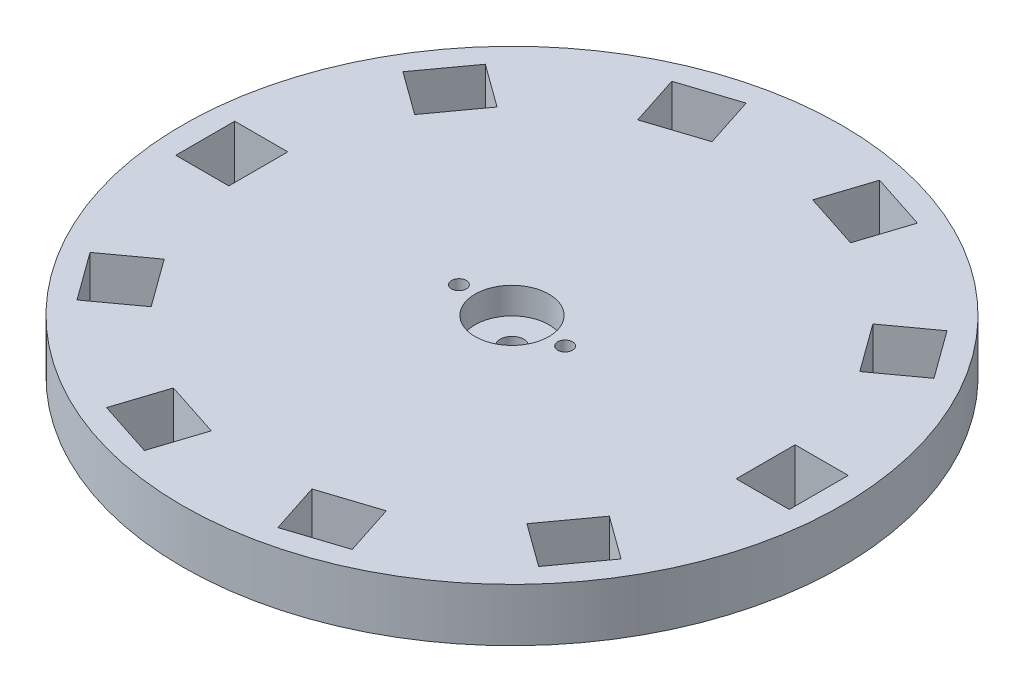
ISO-10303-21;
HEADER;
FILE_DESCRIPTION(('STEP AP214'),'2;1');
FILE_NAME('part.step','',(''),(''),'','','');
FILE_SCHEMA(('AUTOMOTIVE_DESIGN { 1 0 10303 214 1 1 1 1 }'));
ENDSEC;
DATA;
#1=APPLICATION_CONTEXT('core data for automotive mechanical design processes');
#2=APPLICATION_PROTOCOL_DEFINITION('international standard','automotive_design',2000,#1);
#3=PRODUCT_CONTEXT('',#1,'mechanical');
#4=PRODUCT('Part','Part','',(#3));
#5=PRODUCT_RELATED_PRODUCT_CATEGORY('part','',(#4));
#6=PRODUCT_DEFINITION_FORMATION('','',#4);
#7=PRODUCT_DEFINITION_CONTEXT('part definition',#1,'design');
#8=PRODUCT_DEFINITION('design','',#6,#7);
#9=PRODUCT_DEFINITION_SHAPE('','',#8);
#10=(LENGTH_UNIT() NAMED_UNIT(*) SI_UNIT(.MILLI.,.METRE.));
#11=(NAMED_UNIT(*) PLANE_ANGLE_UNIT() SI_UNIT($,.RADIAN.));
#12=(NAMED_UNIT(*) SI_UNIT($,.STERADIAN.) SOLID_ANGLE_UNIT());
#13=UNCERTAINTY_MEASURE_WITH_UNIT(LENGTH_MEASURE(1.E-05),#10,'distance_accuracy_value','');
#14=(GEOMETRIC_REPRESENTATION_CONTEXT(3) GLOBAL_UNCERTAINTY_ASSIGNED_CONTEXT((#13)) GLOBAL_UNIT_ASSIGNED_CONTEXT((#10,
#11,#12)) REPRESENTATION_CONTEXT('',''));
#15=CARTESIAN_POINT('',(0.,0.,0.));
#16=DIRECTION('',(0.,0.,1.));
#17=DIRECTION('',(1.,0.,0.));
#18=AXIS2_PLACEMENT_3D('',#15,#16,#17);
#19=CARTESIAN_POINT('',(0.,0.,0.));
#20=DIRECTION('',(0.,1.,0.));
#21=DIRECTION('',(0.,0.,1.));
#22=AXIS2_PLACEMENT_3D('',#19,#20,#21);
#23=CYLINDRICAL_SURFACE('',#22,4.);
#24=CARTESIAN_POINT('',(0.,0.,0.));
#25=DIRECTION('',(0.,1.,0.));
#26=DIRECTION('',(0.,0.,1.));
#27=AXIS2_PLACEMENT_3D('',#24,#25,#26);
#28=CIRCLE('',#27,4.);
#29=CARTESIAN_POINT('',(0.,0.,4.));
#30=VERTEX_POINT('',#29);
#31=EDGE_CURVE('E636',#30,#30,#28,.T.);
#32=ORIENTED_EDGE('',*,*,#31,.F.);
#33=EDGE_LOOP('',(#32));
#34=FACE_BOUND('',#33,.T.);
#35=CARTESIAN_POINT('',(0.,9.,0.));
#36=DIRECTION('',(0.,1.,0.));
#37=DIRECTION('',(0.,0.,1.));
#38=AXIS2_PLACEMENT_3D('',#35,#36,#37);
#39=CIRCLE('',#38,4.);
#40=CARTESIAN_POINT('',(0.,9.,4.));
#41=VERTEX_POINT('',#40);
#42=EDGE_CURVE('E37',#41,#41,#39,.F.);
#43=ORIENTED_EDGE('',*,*,#42,.F.);
#44=EDGE_LOOP('',(#43));
#45=FACE_BOUND('',#44,.T.);
#46=ADVANCED_FACE('F33',(#34,#45),#23,.F.);
#47=CARTESIAN_POINT('',(0.,18.,0.));
#48=DIRECTION('',(0.,-1.,0.));
#49=DIRECTION('',(0.,0.,-1.));
#50=AXIS2_PLACEMENT_3D('',#47,#48,#49);
#51=CYLINDRICAL_SURFACE('',#50,111.73);
#52=CARTESIAN_POINT('',(0.,18.,0.));
#53=DIRECTION('',(0.,1.,0.));
#54=DIRECTION('',(0.,0.,1.));
#55=AXIS2_PLACEMENT_3D('',#52,#53,#54);
#56=CIRCLE('',#55,111.73);
#57=CARTESIAN_POINT('',(0.,18.,111.73));
#58=VERTEX_POINT('',#57);
#59=EDGE_CURVE('E11',#58,#58,#56,.T.);
#60=ORIENTED_EDGE('',*,*,#59,.F.);
#61=EDGE_LOOP('',(#60));
#62=FACE_BOUND('',#61,.T.);
#63=CARTESIAN_POINT('',(0.,0.,0.));
#64=DIRECTION('',(0.,1.,0.));
#65=DIRECTION('',(0.,0.,1.));
#66=AXIS2_PLACEMENT_3D('',#63,#64,#65);
#67=CIRCLE('',#66,111.73);
#68=CARTESIAN_POINT('',(0.,0.,111.73));
#69=VERTEX_POINT('',#68);
#70=EDGE_CURVE('E42',#69,#69,#67,.T.);
#71=ORIENTED_EDGE('',*,*,#70,.T.);
#72=EDGE_LOOP('',(#71));
#73=FACE_BOUND('',#72,.T.);
#74=ADVANCED_FACE('F35',(#62,#73),#51,.T.);
#75=CARTESIAN_POINT('',(0.,18.,0.));
#76=DIRECTION('',(0.,1.,0.));
#77=DIRECTION('',(0.,0.,1.));
#78=AXIS2_PLACEMENT_3D('',#75,#76,#77);
#79=PLANE('',#78);
#80=DIRECTION('',(-0.587785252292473,0.,-0.809016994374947));
#81=VECTOR('',#80,1.);
#82=CARTESIAN_POINT('',(75.4533140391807,18.,-42.4593617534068));
#83=LINE('',#82,#81);
#84=CARTESIAN_POINT('',(75.4533140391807,18.,-42.4593617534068));
#85=VERTEX_POINT('',#84);
#86=CARTESIAN_POINT('',(63.6976089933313,18.,-58.6397016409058));
#87=VERTEX_POINT('',#86);
#88=EDGE_CURVE('E296',#85,#87,#83,.T.);
#89=ORIENTED_EDGE('',*,*,#88,.T.);
#90=DIRECTION('',(0.809016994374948,0.,-0.587785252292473));
#91=VECTOR('',#90,1.);
#92=CARTESIAN_POINT('',(78.2599148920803,18.,-69.2198361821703));
#93=LINE('',#92,#91);
#94=CARTESIAN_POINT('',(78.2599148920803,18.,-69.2198361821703));
#95=VERTEX_POINT('',#94);
#96=EDGE_CURVE('E307',#87,#95,#93,.T.);
#97=ORIENTED_EDGE('',*,*,#96,.T.);
#98=DIRECTION('',(0.587785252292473,0.,0.809016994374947));
#99=VECTOR('',#98,1.);
#100=CARTESIAN_POINT('',(90.0156199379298,18.,-53.0394962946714));
#101=LINE('',#100,#99);
#102=CARTESIAN_POINT('',(90.0156199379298,18.,-53.0394962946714));
#103=VERTEX_POINT('',#102);
#104=EDGE_CURVE('E50',#95,#103,#101,.T.);
#105=ORIENTED_EDGE('',*,*,#104,.T.);
#106=DIRECTION('',(-0.809016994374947,0.,0.587785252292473));
#107=VECTOR('',#106,1.);
#108=CARTESIAN_POINT('',(90.0156199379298,18.,-53.0394962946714));
#109=LINE('',#108,#107);
#110=EDGE_CURVE('E304',#103,#85,#109,.T.);
#111=ORIENTED_EDGE('',*,*,#110,.T.);
#112=EDGE_LOOP('',(#89,#97,#105,#111));
#113=FACE_BOUND('',#112,.T.);
#114=DIRECTION('',(-0.951056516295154,0.,-0.309016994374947));
#115=VECTOR('',#114,1.);
#116=CARTESIAN_POINT('',(36.0860266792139,18.,-78.7006904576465));
#117=LINE('',#116,#115);
#118=CARTESIAN_POINT('',(36.0860266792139,18.,-78.7006904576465));
#119=VERTEX_POINT('',#118);
#120=CARTESIAN_POINT('',(17.0648963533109,18.,-84.8810303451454));
#121=VERTEX_POINT('',#120);
#122=EDGE_CURVE('E334',#119,#121,#117,.T.);
#123=ORIENTED_EDGE('',*,*,#122,.T.);
#124=DIRECTION('',(0.309016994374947,0.,-0.951056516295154));
#125=VECTOR('',#124,1.);
#126=CARTESIAN_POINT('',(22.6272022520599,18.,-102.000047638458));
#127=LINE('',#126,#125);
#128=CARTESIAN_POINT('',(22.6272022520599,18.,-102.000047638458));
#129=VERTEX_POINT('',#128);
#130=EDGE_CURVE('E337',#121,#129,#127,.T.);
#131=ORIENTED_EDGE('',*,*,#130,.T.);
#132=DIRECTION('',(0.951056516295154,0.,0.309016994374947));
#133=VECTOR('',#132,1.);
#134=CARTESIAN_POINT('',(41.648332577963,18.,-95.8197077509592));
#135=LINE('',#134,#133);
#136=CARTESIAN_POINT('',(41.648332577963,18.,-95.8197077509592));
#137=VERTEX_POINT('',#136);
#138=EDGE_CURVE('E58',#129,#137,#135,.T.);
#139=ORIENTED_EDGE('',*,*,#138,.T.);
#140=DIRECTION('',(-0.309016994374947,0.,0.951056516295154));
#141=VECTOR('',#140,1.);
#142=CARTESIAN_POINT('',(41.648332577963,18.,-95.8197077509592));
#143=LINE('',#142,#141);
#144=EDGE_CURVE('E342',#137,#119,#143,.T.);
#145=ORIENTED_EDGE('',*,*,#144,.T.);
#146=EDGE_LOOP('',(#123,#131,#139,#145));
#147=FACE_BOUND('',#146,.T.);
#148=DIRECTION('',(-0.951056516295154,0.,0.309016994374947));
#149=VECTOR('',#148,1.);
#150=CARTESIAN_POINT('',(-17.0648963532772,18.,-84.8810303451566));
#151=LINE('',#150,#149);
#152=CARTESIAN_POINT('',(-17.0648963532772,18.,-84.8810303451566));
#153=VERTEX_POINT('',#152);
#154=CARTESIAN_POINT('',(-36.0860266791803,18.,-78.7006904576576));
#155=VERTEX_POINT('',#154);
#156=EDGE_CURVE('E364',#153,#155,#151,.T.);
#157=ORIENTED_EDGE('',*,*,#156,.T.);
#158=DIRECTION('',(-0.309016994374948,0.,-0.951056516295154));
#159=VECTOR('',#158,1.);
#160=CARTESIAN_POINT('',(-41.6483325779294,18.,-95.8197077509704));
#161=LINE('',#160,#159);
#162=CARTESIAN_POINT('',(-41.6483325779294,18.,-95.8197077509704));
#163=VERTEX_POINT('',#162);
#164=EDGE_CURVE('E367',#155,#163,#161,.T.);
#165=ORIENTED_EDGE('',*,*,#164,.T.);
#166=DIRECTION('',(0.951056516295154,0.,-0.309016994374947));
#167=VECTOR('',#166,1.);
#168=CARTESIAN_POINT('',(-22.6272022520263,18.,-102.000047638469));
#169=LINE('',#168,#167);
#170=CARTESIAN_POINT('',(-22.6272022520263,18.,-102.000047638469));
#171=VERTEX_POINT('',#170);
#172=EDGE_CURVE('E371',#163,#171,#169,.T.);
#173=ORIENTED_EDGE('',*,*,#172,.T.);
#174=DIRECTION('',(0.309016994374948,0.,0.951056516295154));
#175=VECTOR('',#174,1.);
#176=CARTESIAN_POINT('',(-22.6272022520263,18.,-102.000047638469));
#177=LINE('',#176,#175);
#178=EDGE_CURVE('E374',#171,#153,#177,.T.);
#179=ORIENTED_EDGE('',*,*,#178,.T.);
#180=EDGE_LOOP('',(#157,#165,#173,#179));
#181=FACE_BOUND('',#180,.T.);
#182=DIRECTION('',(-0.587785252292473,0.,0.809016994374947));
#183=VECTOR('',#182,1.);
#184=CARTESIAN_POINT('',(-63.6976089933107,18.,-58.6397016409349));
#185=LINE('',#184,#183);
#186=CARTESIAN_POINT('',(-63.6976089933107,18.,-58.6397016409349));
#187=VERTEX_POINT('',#186);
#188=CARTESIAN_POINT('',(-75.4533140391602,18.,-42.459361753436));
#189=VERTEX_POINT('',#188);
#190=EDGE_CURVE('E396',#187,#189,#185,.T.);
#191=ORIENTED_EDGE('',*,*,#190,.T.);
#192=DIRECTION('',(-0.809016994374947,0.,-0.587785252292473));
#193=VECTOR('',#192,1.);
#194=CARTESIAN_POINT('',(-90.0156199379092,18.,-53.0394962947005));
#195=LINE('',#194,#193);
#196=CARTESIAN_POINT('',(-90.0156199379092,18.,-53.0394962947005));
#197=VERTEX_POINT('',#196);
#198=EDGE_CURVE('E399',#189,#197,#195,.T.);
#199=ORIENTED_EDGE('',*,*,#198,.T.);
#200=DIRECTION('',(0.587785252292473,0.,-0.809016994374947));
#201=VECTOR('',#200,1.);
#202=CARTESIAN_POINT('',(-78.2599148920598,18.,-69.2198361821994));
#203=LINE('',#202,#201);
#204=CARTESIAN_POINT('',(-78.2599148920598,18.,-69.2198361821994));
#205=VERTEX_POINT('',#204);
#206=EDGE_CURVE('E403',#197,#205,#203,.T.);
#207=ORIENTED_EDGE('',*,*,#206,.T.);
#208=DIRECTION('',(0.809016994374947,0.,0.587785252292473));
#209=VECTOR('',#208,1.);
#210=CARTESIAN_POINT('',(-78.2599148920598,18.,-69.2198361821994));
#211=LINE('',#210,#209);
#212=EDGE_CURVE('E406',#205,#187,#211,.T.);
#213=ORIENTED_EDGE('',*,*,#212,.T.);
#214=EDGE_LOOP('',(#191,#199,#207,#213));
#215=FACE_BOUND('',#214,.T.);
#216=DIRECTION('',(0.,0.,1.));
#217=VECTOR('',#216,1.);
#218=CARTESIAN_POINT('',(-86.0000000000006,18.,-10.000000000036));
#219=LINE('',#218,#217);
#220=CARTESIAN_POINT('',(-86.0000000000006,18.,-10.000000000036));
#221=VERTEX_POINT('',#220);
#222=CARTESIAN_POINT('',(-86.0000000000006,18.,9.99999999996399));
#223=VERTEX_POINT('',#222);
#224=EDGE_CURVE('E428',#221,#223,#219,.T.);
#225=ORIENTED_EDGE('',*,*,#224,.T.);
#226=DIRECTION('',(-1.,0.,0.));
#227=VECTOR('',#226,1.);
#228=CARTESIAN_POINT('',(-104.000000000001,18.,9.99999999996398));
#229=LINE('',#228,#227);
#230=CARTESIAN_POINT('',(-104.000000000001,18.,9.99999999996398));
#231=VERTEX_POINT('',#230);
#232=EDGE_CURVE('E431',#223,#231,#229,.T.);
#233=ORIENTED_EDGE('',*,*,#232,.T.);
#234=DIRECTION('',(0.,0.,-1.));
#235=VECTOR('',#234,1.);
#236=CARTESIAN_POINT('',(-104.000000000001,18.,-10.000000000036));
#237=LINE('',#236,#235);
#238=CARTESIAN_POINT('',(-104.000000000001,18.,-10.000000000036));
#239=VERTEX_POINT('',#238);
#240=EDGE_CURVE('E435',#231,#239,#237,.T.);
#241=ORIENTED_EDGE('',*,*,#240,.T.);
#242=DIRECTION('',(1.,0.,0.));
#243=VECTOR('',#242,1.);
#244=CARTESIAN_POINT('',(-104.000000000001,18.,-10.000000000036));
#245=LINE('',#244,#243);
#246=EDGE_CURVE('E438',#239,#221,#245,.T.);
#247=ORIENTED_EDGE('',*,*,#246,.T.);
#248=EDGE_LOOP('',(#225,#233,#241,#247));
#249=FACE_BOUND('',#248,.T.);
#250=DIRECTION('',(0.587785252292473,0.,0.809016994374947));
#251=VECTOR('',#250,1.);
#252=CARTESIAN_POINT('',(-75.4533140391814,18.,42.4593617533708));
#253=LINE('',#252,#251);
#254=CARTESIAN_POINT('',(-75.4533140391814,18.,42.4593617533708));
#255=VERTEX_POINT('',#254);
#256=CARTESIAN_POINT('',(-63.6976089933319,18.,58.6397016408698));
#257=VERTEX_POINT('',#256);
#258=EDGE_CURVE('E460',#255,#257,#253,.T.);
#259=ORIENTED_EDGE('',*,*,#258,.T.);
#260=DIRECTION('',(-0.809016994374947,0.,0.587785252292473));
#261=VECTOR('',#260,1.);
#262=CARTESIAN_POINT('',(-78.259914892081,18.,69.2198361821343));
#263=LINE('',#262,#261);
#264=CARTESIAN_POINT('',(-78.259914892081,18.,69.2198361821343));
#265=VERTEX_POINT('',#264);
#266=EDGE_CURVE('E463',#257,#265,#263,.T.);
#267=ORIENTED_EDGE('',*,*,#266,.T.);
#268=DIRECTION('',(-0.587785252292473,0.,-0.809016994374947));
#269=VECTOR('',#268,1.);
#270=CARTESIAN_POINT('',(-90.0156199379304,18.,53.0394962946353));
#271=LINE('',#270,#269);
#272=CARTESIAN_POINT('',(-90.0156199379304,18.,53.0394962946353));
#273=VERTEX_POINT('',#272);
#274=EDGE_CURVE('E467',#265,#273,#271,.T.);
#275=ORIENTED_EDGE('',*,*,#274,.T.);
#276=DIRECTION('',(0.809016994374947,0.,-0.587785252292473));
#277=VECTOR('',#276,1.);
#278=CARTESIAN_POINT('',(-90.0156199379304,18.,53.0394962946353));
#279=LINE('',#278,#277);
#280=EDGE_CURVE('E470',#273,#255,#279,.T.);
#281=ORIENTED_EDGE('',*,*,#280,.T.);
#282=EDGE_LOOP('',(#259,#267,#275,#281));
#283=FACE_BOUND('',#282,.T.);
#284=DIRECTION('',(0.951056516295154,0.,0.309016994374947));
#285=VECTOR('',#284,1.);
#286=CARTESIAN_POINT('',(-36.0860266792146,18.,78.7006904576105));
#287=LINE('',#286,#285);
#288=CARTESIAN_POINT('',(-36.0860266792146,18.,78.7006904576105));
#289=VERTEX_POINT('',#288);
#290=CARTESIAN_POINT('',(-17.0648963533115,18.,84.8810303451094));
#291=VERTEX_POINT('',#290);
#292=EDGE_CURVE('E492',#289,#291,#287,.T.);
#293=ORIENTED_EDGE('',*,*,#292,.T.);
#294=DIRECTION('',(-0.309016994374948,0.,0.951056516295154));
#295=VECTOR('',#294,1.);
#296=CARTESIAN_POINT('',(-22.6272022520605,18.,102.000047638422));
#297=LINE('',#296,#295);
#298=CARTESIAN_POINT('',(-22.6272022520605,18.,102.000047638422));
#299=VERTEX_POINT('',#298);
#300=EDGE_CURVE('E495',#291,#299,#297,.T.);
#301=ORIENTED_EDGE('',*,*,#300,.T.);
#302=DIRECTION('',(-0.951056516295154,0.,-0.309016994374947));
#303=VECTOR('',#302,1.);
#304=CARTESIAN_POINT('',(-41.6483325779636,18.,95.8197077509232));
#305=LINE('',#304,#303);
#306=CARTESIAN_POINT('',(-41.6483325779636,18.,95.8197077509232));
#307=VERTEX_POINT('',#306);
#308=EDGE_CURVE('E499',#299,#307,#305,.T.);
#309=ORIENTED_EDGE('',*,*,#308,.T.);
#310=DIRECTION('',(0.309016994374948,0.,-0.951056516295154));
#311=VECTOR('',#310,1.);
#312=CARTESIAN_POINT('',(-41.6483325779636,18.,95.8197077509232));
#313=LINE('',#312,#311);
#314=EDGE_CURVE('E502',#307,#289,#313,.T.);
#315=ORIENTED_EDGE('',*,*,#314,.T.);
#316=EDGE_LOOP('',(#293,#301,#309,#315));
#317=FACE_BOUND('',#316,.T.);
#318=DIRECTION('',(0.951056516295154,0.,-0.309016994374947));
#319=VECTOR('',#318,1.);
#320=CARTESIAN_POINT('',(17.0648963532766,18.,84.8810303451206));
#321=LINE('',#320,#319);
#322=CARTESIAN_POINT('',(17.0648963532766,18.,84.8810303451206));
#323=VERTEX_POINT('',#322);
#324=CARTESIAN_POINT('',(36.0860266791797,18.,78.7006904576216));
#325=VERTEX_POINT('',#324);
#326=EDGE_CURVE('E524',#323,#325,#321,.T.);
#327=ORIENTED_EDGE('',*,*,#326,.T.);
#328=DIRECTION('',(0.309016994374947,0.,0.951056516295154));
#329=VECTOR('',#328,1.);
#330=CARTESIAN_POINT('',(41.6483325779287,18.,95.8197077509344));
#331=LINE('',#330,#329);
#332=CARTESIAN_POINT('',(41.6483325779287,18.,95.8197077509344));
#333=VERTEX_POINT('',#332);
#334=EDGE_CURVE('E527',#325,#333,#331,.T.);
#335=ORIENTED_EDGE('',*,*,#334,.T.);
#336=DIRECTION('',(-0.951056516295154,0.,0.309016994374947));
#337=VECTOR('',#336,1.);
#338=CARTESIAN_POINT('',(22.6272022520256,18.,102.000047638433));
#339=LINE('',#338,#337);
#340=CARTESIAN_POINT('',(22.6272022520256,18.,102.000047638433));
#341=VERTEX_POINT('',#340);
#342=EDGE_CURVE('E531',#333,#341,#339,.T.);
#343=ORIENTED_EDGE('',*,*,#342,.T.);
#344=DIRECTION('',(-0.309016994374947,0.,-0.951056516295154));
#345=VECTOR('',#344,1.);
#346=CARTESIAN_POINT('',(22.6272022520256,18.,102.000047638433));
#347=LINE('',#346,#345);
#348=EDGE_CURVE('E534',#341,#323,#347,.T.);
#349=ORIENTED_EDGE('',*,*,#348,.T.);
#350=EDGE_LOOP('',(#327,#335,#343,#349));
#351=FACE_BOUND('',#350,.T.);
#352=DIRECTION('',(0.587785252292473,0.,-0.809016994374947));
#353=VECTOR('',#352,1.);
#354=CARTESIAN_POINT('',(63.6976089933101,18.,58.6397016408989));
#355=LINE('',#354,#353);
#356=CARTESIAN_POINT('',(63.6976089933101,18.,58.6397016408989));
#357=VERTEX_POINT('',#356);
#358=CARTESIAN_POINT('',(75.4533140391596,18.,42.4593617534));
#359=VERTEX_POINT('',#358);
#360=EDGE_CURVE('E556',#357,#359,#355,.T.);
#361=ORIENTED_EDGE('',*,*,#360,.T.);
#362=DIRECTION('',(0.809016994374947,0.,0.587785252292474));
#363=VECTOR('',#362,1.);
#364=CARTESIAN_POINT('',(90.0156199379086,18.,53.0394962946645));
#365=LINE('',#364,#363);
#366=CARTESIAN_POINT('',(90.0156199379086,18.,53.0394962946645));
#367=VERTEX_POINT('',#366);
#368=EDGE_CURVE('E559',#359,#367,#365,.T.);
#369=ORIENTED_EDGE('',*,*,#368,.T.);
#370=DIRECTION('',(-0.587785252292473,0.,0.809016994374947));
#371=VECTOR('',#370,1.);
#372=CARTESIAN_POINT('',(78.2599148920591,18.,69.2198361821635));
#373=LINE('',#372,#371);
#374=CARTESIAN_POINT('',(78.2599148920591,18.,69.2198361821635));
#375=VERTEX_POINT('',#374);
#376=EDGE_CURVE('E563',#367,#375,#373,.T.);
#377=ORIENTED_EDGE('',*,*,#376,.T.);
#378=DIRECTION('',(-0.809016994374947,0.,-0.587785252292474));
#379=VECTOR('',#378,1.);
#380=CARTESIAN_POINT('',(78.2599148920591,18.,69.2198361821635));
#381=LINE('',#380,#379);
#382=EDGE_CURVE('E566',#375,#357,#381,.T.);
#383=ORIENTED_EDGE('',*,*,#382,.T.);
#384=EDGE_LOOP('',(#361,#369,#377,#383));
#385=FACE_BOUND('',#384,.T.);
#386=DIRECTION('',(0.,0.,-1.));
#387=VECTOR('',#386,1.);
#388=CARTESIAN_POINT('',(86.,18.,10.));
#389=LINE('',#388,#387);
#390=CARTESIAN_POINT('',(86.,18.,10.));
#391=VERTEX_POINT('',#390);
#392=CARTESIAN_POINT('',(86.,18.,-10.));
#393=VERTEX_POINT('',#392);
#394=EDGE_CURVE('E587',#391,#393,#389,.T.);
#395=ORIENTED_EDGE('',*,*,#394,.T.);
#396=DIRECTION('',(1.,0.,0.));
#397=VECTOR('',#396,1.);
#398=CARTESIAN_POINT('',(104.,18.,-10.));
#399=LINE('',#398,#397);
#400=CARTESIAN_POINT('',(104.,18.,-10.));
#401=VERTEX_POINT('',#400);
#402=EDGE_CURVE('E590',#393,#401,#399,.T.);
#403=ORIENTED_EDGE('',*,*,#402,.T.);
#404=DIRECTION('',(0.,0.,1.));
#405=VECTOR('',#404,1.);
#406=CARTESIAN_POINT('',(104.,18.,10.));
#407=LINE('',#406,#405);
#408=CARTESIAN_POINT('',(104.,18.,10.));
#409=VERTEX_POINT('',#408);
#410=EDGE_CURVE('E594',#401,#409,#407,.T.);
#411=ORIENTED_EDGE('',*,*,#410,.T.);
#412=DIRECTION('',(-1.,0.,0.));
#413=VECTOR('',#412,1.);
#414=CARTESIAN_POINT('',(104.,18.,10.));
#415=LINE('',#414,#413);
#416=EDGE_CURVE('E597',#409,#391,#415,.T.);
#417=ORIENTED_EDGE('',*,*,#416,.T.);
#418=EDGE_LOOP('',(#395,#403,#411,#417));
#419=FACE_BOUND('',#418,.T.);
#420=CARTESIAN_POINT('',(-18.,18.,0.));
#421=DIRECTION('',(0.,1.,0.));
#422=DIRECTION('',(0.,0.,-1.));
#423=AXIS2_PLACEMENT_3D('',#420,#421,#422);
#424=CIRCLE('',#423,2.5);
#425=CARTESIAN_POINT('',(-18.,18.,-2.5));
#426=VERTEX_POINT('',#425);
#427=EDGE_CURVE('E612',#426,#426,#424,.T.);
#428=ORIENTED_EDGE('',*,*,#427,.F.);
#429=EDGE_LOOP('',(#428));
#430=FACE_BOUND('',#429,.T.);
#431=CARTESIAN_POINT('',(18.,18.,0.));
#432=DIRECTION('',(0.,1.,0.));
#433=DIRECTION('',(0.,0.,1.));
#434=AXIS2_PLACEMENT_3D('',#431,#432,#433);
#435=CIRCLE('',#434,2.5);
#436=CARTESIAN_POINT('',(18.,18.,2.50000000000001));
#437=VERTEX_POINT('',#436);
#438=EDGE_CURVE('E622',#437,#437,#435,.T.);
#439=ORIENTED_EDGE('',*,*,#438,.F.);
#440=EDGE_LOOP('',(#439));
#441=FACE_BOUND('',#440,.T.);
#442=CARTESIAN_POINT('',(0.,18.,0.));
#443=DIRECTION('',(0.,1.,0.));
#444=DIRECTION('',(0.,0.,1.));
#445=AXIS2_PLACEMENT_3D('',#442,#443,#444);
#446=CIRCLE('',#445,12.5);
#447=CARTESIAN_POINT('',(0.,18.,12.5));
#448=VERTEX_POINT('',#447);
#449=EDGE_CURVE('E628',#448,#448,#446,.T.);
#450=ORIENTED_EDGE('',*,*,#449,.F.);
#451=EDGE_LOOP('',(#450));
#452=FACE_BOUND('',#451,.T.);
#453=ORIENTED_EDGE('',*,*,#59,.T.);
#454=EDGE_LOOP('',(#453));
#455=FACE_BOUND('',#454,.T.);
#456=ADVANCED_FACE('F311',(#113,#147,#181,#215,#249,#283,#317,#351,#385,#419,#430,#441,#452,
#455),#79,.T.);
#457=CARTESIAN_POINT('',(0.,0.,0.));
#458=DIRECTION('',(0.,1.,0.));
#459=DIRECTION('',(0.,0.,1.));
#460=AXIS2_PLACEMENT_3D('',#457,#458,#459);
#461=PLANE('',#460);
#462=DIRECTION('',(0.809016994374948,0.,-0.587785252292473));
#463=VECTOR('',#462,1.);
#464=CARTESIAN_POINT('',(78.2599148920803,0.,-69.2198361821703));
#465=LINE('',#464,#463);
#466=CARTESIAN_POINT('',(63.6976089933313,0.,-58.6397016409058));
#467=VERTEX_POINT('',#466);
#468=CARTESIAN_POINT('',(78.2599148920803,0.,-69.2198361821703));
#469=VERTEX_POINT('',#468);
#470=EDGE_CURVE('E323',#467,#469,#465,.T.);
#471=ORIENTED_EDGE('',*,*,#470,.F.);
#472=DIRECTION('',(-0.587785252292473,0.,-0.809016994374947));
#473=VECTOR('',#472,1.);
#474=CARTESIAN_POINT('',(75.4533140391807,0.,-42.4593617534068));
#475=LINE('',#474,#473);
#476=CARTESIAN_POINT('',(75.4533140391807,0.,-42.4593617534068));
#477=VERTEX_POINT('',#476);
#478=EDGE_CURVE('E299',#477,#467,#475,.T.);
#479=ORIENTED_EDGE('',*,*,#478,.F.);
#480=DIRECTION('',(-0.809016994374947,0.,0.587785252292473));
#481=VECTOR('',#480,1.);
#482=CARTESIAN_POINT('',(90.0156199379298,0.,-53.0394962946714));
#483=LINE('',#482,#481);
#484=CARTESIAN_POINT('',(90.0156199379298,0.,-53.0394962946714));
#485=VERTEX_POINT('',#484);
#486=EDGE_CURVE('E314',#485,#477,#483,.T.);
#487=ORIENTED_EDGE('',*,*,#486,.F.);
#488=DIRECTION('',(0.587785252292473,0.,0.809016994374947));
#489=VECTOR('',#488,1.);
#490=CARTESIAN_POINT('',(90.0156199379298,0.,-53.0394962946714));
#491=LINE('',#490,#489);
#492=EDGE_CURVE('E317',#469,#485,#491,.T.);
#493=ORIENTED_EDGE('',*,*,#492,.F.);
#494=EDGE_LOOP('',(#471,#479,#487,#493));
#495=FACE_BOUND('',#494,.T.);
#496=DIRECTION('',(0.309016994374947,0.,-0.951056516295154));
#497=VECTOR('',#496,1.);
#498=CARTESIAN_POINT('',(22.6272022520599,0.,-102.000047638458));
#499=LINE('',#498,#497);
#500=CARTESIAN_POINT('',(17.0648963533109,0.,-84.8810303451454));
#501=VERTEX_POINT('',#500);
#502=CARTESIAN_POINT('',(22.6272022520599,0.,-102.000047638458));
#503=VERTEX_POINT('',#502);
#504=EDGE_CURVE('E348',#501,#503,#499,.T.);
#505=ORIENTED_EDGE('',*,*,#504,.F.);
#506=DIRECTION('',(-0.951056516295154,0.,-0.309016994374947));
#507=VECTOR('',#506,1.);
#508=CARTESIAN_POINT('',(36.0860266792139,0.,-78.7006904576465));
#509=LINE('',#508,#507);
#510=CARTESIAN_POINT('',(36.0860266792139,0.,-78.7006904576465));
#511=VERTEX_POINT('',#510);
#512=EDGE_CURVE('E346',#511,#501,#509,.T.);
#513=ORIENTED_EDGE('',*,*,#512,.F.);
#514=DIRECTION('',(-0.309016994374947,0.,0.951056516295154));
#515=VECTOR('',#514,1.);
#516=CARTESIAN_POINT('',(41.648332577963,0.,-95.8197077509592));
#517=LINE('',#516,#515);
#518=CARTESIAN_POINT('',(41.648332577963,0.,-95.8197077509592));
#519=VERTEX_POINT('',#518);
#520=EDGE_CURVE('E338',#519,#511,#517,.T.);
#521=ORIENTED_EDGE('',*,*,#520,.F.);
#522=DIRECTION('',(0.951056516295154,0.,0.309016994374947));
#523=VECTOR('',#522,1.);
#524=CARTESIAN_POINT('',(41.648332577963,0.,-95.8197077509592));
#525=LINE('',#524,#523);
#526=EDGE_CURVE('E352',#503,#519,#525,.T.);
#527=ORIENTED_EDGE('',*,*,#526,.F.);
#528=EDGE_LOOP('',(#505,#513,#521,#527));
#529=FACE_BOUND('',#528,.T.);
#530=DIRECTION('',(-0.309016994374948,0.,-0.951056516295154));
#531=VECTOR('',#530,1.);
#532=CARTESIAN_POINT('',(-41.6483325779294,0.,-95.8197077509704));
#533=LINE('',#532,#531);
#534=CARTESIAN_POINT('',(-36.0860266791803,0.,-78.7006904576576));
#535=VERTEX_POINT('',#534);
#536=CARTESIAN_POINT('',(-41.6483325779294,0.,-95.8197077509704));
#537=VERTEX_POINT('',#536);
#538=EDGE_CURVE('E380',#535,#537,#533,.T.);
#539=ORIENTED_EDGE('',*,*,#538,.F.);
#540=DIRECTION('',(-0.951056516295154,0.,0.309016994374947));
#541=VECTOR('',#540,1.);
#542=CARTESIAN_POINT('',(-17.0648963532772,0.,-84.8810303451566));
#543=LINE('',#542,#541);
#544=CARTESIAN_POINT('',(-17.0648963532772,0.,-84.8810303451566));
#545=VERTEX_POINT('',#544);
#546=EDGE_CURVE('E378',#545,#535,#543,.T.);
#547=ORIENTED_EDGE('',*,*,#546,.F.);
#548=DIRECTION('',(0.309016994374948,0.,0.951056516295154));
#549=VECTOR('',#548,1.);
#550=CARTESIAN_POINT('',(-22.6272022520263,0.,-102.000047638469));
#551=LINE('',#550,#549);
#552=CARTESIAN_POINT('',(-22.6272022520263,0.,-102.000047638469));
#553=VERTEX_POINT('',#552);
#554=EDGE_CURVE('E368',#553,#545,#551,.T.);
#555=ORIENTED_EDGE('',*,*,#554,.F.);
#556=DIRECTION('',(0.951056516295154,0.,-0.309016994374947));
#557=VECTOR('',#556,1.);
#558=CARTESIAN_POINT('',(-22.6272022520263,0.,-102.000047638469));
#559=LINE('',#558,#557);
#560=EDGE_CURVE('E384',#537,#553,#559,.T.);
#561=ORIENTED_EDGE('',*,*,#560,.F.);
#562=EDGE_LOOP('',(#539,#547,#555,#561));
#563=FACE_BOUND('',#562,.T.);
#564=DIRECTION('',(-0.809016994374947,0.,-0.587785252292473));
#565=VECTOR('',#564,1.);
#566=CARTESIAN_POINT('',(-90.0156199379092,0.,-53.0394962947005));
#567=LINE('',#566,#565);
#568=CARTESIAN_POINT('',(-75.4533140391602,0.,-42.459361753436));
#569=VERTEX_POINT('',#568);
#570=CARTESIAN_POINT('',(-90.0156199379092,0.,-53.0394962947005));
#571=VERTEX_POINT('',#570);
#572=EDGE_CURVE('E412',#569,#571,#567,.T.);
#573=ORIENTED_EDGE('',*,*,#572,.F.);
#574=DIRECTION('',(-0.587785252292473,0.,0.809016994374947));
#575=VECTOR('',#574,1.);
#576=CARTESIAN_POINT('',(-63.6976089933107,0.,-58.6397016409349));
#577=LINE('',#576,#575);
#578=CARTESIAN_POINT('',(-63.6976089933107,0.,-58.6397016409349));
#579=VERTEX_POINT('',#578);
#580=EDGE_CURVE('E410',#579,#569,#577,.T.);
#581=ORIENTED_EDGE('',*,*,#580,.F.);
#582=DIRECTION('',(0.809016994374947,0.,0.587785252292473));
#583=VECTOR('',#582,1.);
#584=CARTESIAN_POINT('',(-78.2599148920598,0.,-69.2198361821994));
#585=LINE('',#584,#583);
#586=CARTESIAN_POINT('',(-78.2599148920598,0.,-69.2198361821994));
#587=VERTEX_POINT('',#586);
#588=EDGE_CURVE('E400',#587,#579,#585,.T.);
#589=ORIENTED_EDGE('',*,*,#588,.F.);
#590=DIRECTION('',(0.587785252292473,0.,-0.809016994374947));
#591=VECTOR('',#590,1.);
#592=CARTESIAN_POINT('',(-78.2599148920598,0.,-69.2198361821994));
#593=LINE('',#592,#591);
#594=EDGE_CURVE('E416',#571,#587,#593,.T.);
#595=ORIENTED_EDGE('',*,*,#594,.F.);
#596=EDGE_LOOP('',(#573,#581,#589,#595));
#597=FACE_BOUND('',#596,.T.);
#598=DIRECTION('',(-1.,0.,0.));
#599=VECTOR('',#598,1.);
#600=CARTESIAN_POINT('',(-104.000000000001,0.,9.99999999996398));
#601=LINE('',#600,#599);
#602=CARTESIAN_POINT('',(-86.0000000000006,0.,9.99999999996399));
#603=VERTEX_POINT('',#602);
#604=CARTESIAN_POINT('',(-104.000000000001,0.,9.99999999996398));
#605=VERTEX_POINT('',#604);
#606=EDGE_CURVE('E444',#603,#605,#601,.T.);
#607=ORIENTED_EDGE('',*,*,#606,.F.);
#608=DIRECTION('',(0.,0.,1.));
#609=VECTOR('',#608,1.);
#610=CARTESIAN_POINT('',(-86.0000000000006,0.,-10.000000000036));
#611=LINE('',#610,#609);
#612=CARTESIAN_POINT('',(-86.0000000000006,0.,-10.000000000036));
#613=VERTEX_POINT('',#612);
#614=EDGE_CURVE('E442',#613,#603,#611,.T.);
#615=ORIENTED_EDGE('',*,*,#614,.F.);
#616=DIRECTION('',(1.,0.,0.));
#617=VECTOR('',#616,1.);
#618=CARTESIAN_POINT('',(-104.000000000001,0.,-10.000000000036));
#619=LINE('',#618,#617);
#620=CARTESIAN_POINT('',(-104.000000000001,0.,-10.000000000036));
#621=VERTEX_POINT('',#620);
#622=EDGE_CURVE('E432',#621,#613,#619,.T.);
#623=ORIENTED_EDGE('',*,*,#622,.F.);
#624=DIRECTION('',(0.,0.,-1.));
#625=VECTOR('',#624,1.);
#626=CARTESIAN_POINT('',(-104.000000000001,0.,-10.000000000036));
#627=LINE('',#626,#625);
#628=EDGE_CURVE('E448',#605,#621,#627,.T.);
#629=ORIENTED_EDGE('',*,*,#628,.F.);
#630=EDGE_LOOP('',(#607,#615,#623,#629));
#631=FACE_BOUND('',#630,.T.);
#632=DIRECTION('',(-0.809016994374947,0.,0.587785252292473));
#633=VECTOR('',#632,1.);
#634=CARTESIAN_POINT('',(-78.259914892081,0.,69.2198361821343));
#635=LINE('',#634,#633);
#636=CARTESIAN_POINT('',(-63.6976089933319,0.,58.6397016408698));
#637=VERTEX_POINT('',#636);
#638=CARTESIAN_POINT('',(-78.259914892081,0.,69.2198361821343));
#639=VERTEX_POINT('',#638);
#640=EDGE_CURVE('E476',#637,#639,#635,.T.);
#641=ORIENTED_EDGE('',*,*,#640,.F.);
#642=DIRECTION('',(0.587785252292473,0.,0.809016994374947));
#643=VECTOR('',#642,1.);
#644=CARTESIAN_POINT('',(-75.4533140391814,0.,42.4593617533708));
#645=LINE('',#644,#643);
#646=CARTESIAN_POINT('',(-75.4533140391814,0.,42.4593617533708));
#647=VERTEX_POINT('',#646);
#648=EDGE_CURVE('E474',#647,#637,#645,.T.);
#649=ORIENTED_EDGE('',*,*,#648,.F.);
#650=DIRECTION('',(0.809016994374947,0.,-0.587785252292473));
#651=VECTOR('',#650,1.);
#652=CARTESIAN_POINT('',(-90.0156199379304,0.,53.0394962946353));
#653=LINE('',#652,#651);
#654=CARTESIAN_POINT('',(-90.0156199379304,0.,53.0394962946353));
#655=VERTEX_POINT('',#654);
#656=EDGE_CURVE('E464',#655,#647,#653,.T.);
#657=ORIENTED_EDGE('',*,*,#656,.F.);
#658=DIRECTION('',(-0.587785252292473,0.,-0.809016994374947));
#659=VECTOR('',#658,1.);
#660=CARTESIAN_POINT('',(-90.0156199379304,0.,53.0394962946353));
#661=LINE('',#660,#659);
#662=EDGE_CURVE('E480',#639,#655,#661,.T.);
#663=ORIENTED_EDGE('',*,*,#662,.F.);
#664=EDGE_LOOP('',(#641,#649,#657,#663));
#665=FACE_BOUND('',#664,.T.);
#666=DIRECTION('',(-0.309016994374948,0.,0.951056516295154));
#667=VECTOR('',#666,1.);
#668=CARTESIAN_POINT('',(-22.6272022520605,0.,102.000047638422));
#669=LINE('',#668,#667);
#670=CARTESIAN_POINT('',(-17.0648963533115,0.,84.8810303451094));
#671=VERTEX_POINT('',#670);
#672=CARTESIAN_POINT('',(-22.6272022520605,0.,102.000047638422));
#673=VERTEX_POINT('',#672);
#674=EDGE_CURVE('E508',#671,#673,#669,.T.);
#675=ORIENTED_EDGE('',*,*,#674,.F.);
#676=DIRECTION('',(0.951056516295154,0.,0.309016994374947));
#677=VECTOR('',#676,1.);
#678=CARTESIAN_POINT('',(-36.0860266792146,0.,78.7006904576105));
#679=LINE('',#678,#677);
#680=CARTESIAN_POINT('',(-36.0860266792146,0.,78.7006904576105));
#681=VERTEX_POINT('',#680);
#682=EDGE_CURVE('E506',#681,#671,#679,.T.);
#683=ORIENTED_EDGE('',*,*,#682,.F.);
#684=DIRECTION('',(0.309016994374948,0.,-0.951056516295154));
#685=VECTOR('',#684,1.);
#686=CARTESIAN_POINT('',(-41.6483325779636,0.,95.8197077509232));
#687=LINE('',#686,#685);
#688=CARTESIAN_POINT('',(-41.6483325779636,0.,95.8197077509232));
#689=VERTEX_POINT('',#688);
#690=EDGE_CURVE('E496',#689,#681,#687,.T.);
#691=ORIENTED_EDGE('',*,*,#690,.F.);
#692=DIRECTION('',(-0.951056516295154,0.,-0.309016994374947));
#693=VECTOR('',#692,1.);
#694=CARTESIAN_POINT('',(-41.6483325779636,0.,95.8197077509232));
#695=LINE('',#694,#693);
#696=EDGE_CURVE('E512',#673,#689,#695,.T.);
#697=ORIENTED_EDGE('',*,*,#696,.F.);
#698=EDGE_LOOP('',(#675,#683,#691,#697));
#699=FACE_BOUND('',#698,.T.);
#700=DIRECTION('',(0.309016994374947,0.,0.951056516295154));
#701=VECTOR('',#700,1.);
#702=CARTESIAN_POINT('',(41.6483325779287,0.,95.8197077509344));
#703=LINE('',#702,#701);
#704=CARTESIAN_POINT('',(36.0860266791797,0.,78.7006904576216));
#705=VERTEX_POINT('',#704);
#706=CARTESIAN_POINT('',(41.6483325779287,0.,95.8197077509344));
#707=VERTEX_POINT('',#706);
#708=EDGE_CURVE('E540',#705,#707,#703,.T.);
#709=ORIENTED_EDGE('',*,*,#708,.F.);
#710=DIRECTION('',(0.951056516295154,0.,-0.309016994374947));
#711=VECTOR('',#710,1.);
#712=CARTESIAN_POINT('',(17.0648963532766,0.,84.8810303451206));
#713=LINE('',#712,#711);
#714=CARTESIAN_POINT('',(17.0648963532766,0.,84.8810303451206));
#715=VERTEX_POINT('',#714);
#716=EDGE_CURVE('E538',#715,#705,#713,.T.);
#717=ORIENTED_EDGE('',*,*,#716,.F.);
#718=DIRECTION('',(-0.309016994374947,0.,-0.951056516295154));
#719=VECTOR('',#718,1.);
#720=CARTESIAN_POINT('',(22.6272022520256,0.,102.000047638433));
#721=LINE('',#720,#719);
#722=CARTESIAN_POINT('',(22.6272022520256,0.,102.000047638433));
#723=VERTEX_POINT('',#722);
#724=EDGE_CURVE('E528',#723,#715,#721,.T.);
#725=ORIENTED_EDGE('',*,*,#724,.F.);
#726=DIRECTION('',(-0.951056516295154,0.,0.309016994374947));
#727=VECTOR('',#726,1.);
#728=CARTESIAN_POINT('',(22.6272022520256,0.,102.000047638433));
#729=LINE('',#728,#727);
#730=EDGE_CURVE('E544',#707,#723,#729,.T.);
#731=ORIENTED_EDGE('',*,*,#730,.F.);
#732=EDGE_LOOP('',(#709,#717,#725,#731));
#733=FACE_BOUND('',#732,.T.);
#734=DIRECTION('',(0.809016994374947,0.,0.587785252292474));
#735=VECTOR('',#734,1.);
#736=CARTESIAN_POINT('',(90.0156199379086,0.,53.0394962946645));
#737=LINE('',#736,#735);
#738=CARTESIAN_POINT('',(75.4533140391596,0.,42.4593617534));
#739=VERTEX_POINT('',#738);
#740=CARTESIAN_POINT('',(90.0156199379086,0.,53.0394962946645));
#741=VERTEX_POINT('',#740);
#742=EDGE_CURVE('E572',#739,#741,#737,.T.);
#743=ORIENTED_EDGE('',*,*,#742,.F.);
#744=DIRECTION('',(0.587785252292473,0.,-0.809016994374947));
#745=VECTOR('',#744,1.);
#746=CARTESIAN_POINT('',(63.6976089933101,0.,58.6397016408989));
#747=LINE('',#746,#745);
#748=CARTESIAN_POINT('',(63.6976089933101,0.,58.6397016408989));
#749=VERTEX_POINT('',#748);
#750=EDGE_CURVE('E570',#749,#739,#747,.T.);
#751=ORIENTED_EDGE('',*,*,#750,.F.);
#752=DIRECTION('',(-0.809016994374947,0.,-0.587785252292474));
#753=VECTOR('',#752,1.);
#754=CARTESIAN_POINT('',(78.2599148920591,0.,69.2198361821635));
#755=LINE('',#754,#753);
#756=CARTESIAN_POINT('',(78.2599148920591,0.,69.2198361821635));
#757=VERTEX_POINT('',#756);
#758=EDGE_CURVE('E560',#757,#749,#755,.T.);
#759=ORIENTED_EDGE('',*,*,#758,.F.);
#760=DIRECTION('',(-0.587785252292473,0.,0.809016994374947));
#761=VECTOR('',#760,1.);
#762=CARTESIAN_POINT('',(78.2599148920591,0.,69.2198361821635));
#763=LINE('',#762,#761);
#764=EDGE_CURVE('E575',#741,#757,#763,.T.);
#765=ORIENTED_EDGE('',*,*,#764,.F.);
#766=EDGE_LOOP('',(#743,#751,#759,#765));
#767=FACE_BOUND('',#766,.T.);
#768=DIRECTION('',(1.,0.,0.));
#769=VECTOR('',#768,1.);
#770=CARTESIAN_POINT('',(104.,0.,-10.));
#771=LINE('',#770,#769);
#772=CARTESIAN_POINT('',(86.,0.,-10.));
#773=VERTEX_POINT('',#772);
#774=CARTESIAN_POINT('',(104.,0.,-10.));
#775=VERTEX_POINT('',#774);
#776=EDGE_CURVE('E602',#773,#775,#771,.T.);
#777=ORIENTED_EDGE('',*,*,#776,.F.);
#778=DIRECTION('',(0.,0.,-1.));
#779=VECTOR('',#778,1.);
#780=CARTESIAN_POINT('',(86.,0.,10.));
#781=LINE('',#780,#779);
#782=CARTESIAN_POINT('',(86.,0.,10.));
#783=VERTEX_POINT('',#782);
#784=EDGE_CURVE('E330',#783,#773,#781,.T.);
#785=ORIENTED_EDGE('',*,*,#784,.F.);
#786=DIRECTION('',(-1.,0.,0.));
#787=VECTOR('',#786,1.);
#788=CARTESIAN_POINT('',(104.,0.,10.));
#789=LINE('',#788,#787);
#790=CARTESIAN_POINT('',(104.,0.,10.));
#791=VERTEX_POINT('',#790);
#792=EDGE_CURVE('E591',#791,#783,#789,.T.);
#793=ORIENTED_EDGE('',*,*,#792,.F.);
#794=DIRECTION('',(0.,0.,1.));
#795=VECTOR('',#794,1.);
#796=CARTESIAN_POINT('',(104.,0.,10.));
#797=LINE('',#796,#795);
#798=EDGE_CURVE('E605',#775,#791,#797,.T.);
#799=ORIENTED_EDGE('',*,*,#798,.F.);
#800=EDGE_LOOP('',(#777,#785,#793,#799));
#801=FACE_BOUND('',#800,.T.);
#802=CARTESIAN_POINT('',(-18.,0.,0.));
#803=DIRECTION('',(0.,1.,0.));
#804=DIRECTION('',(0.,0.,-1.));
#805=AXIS2_PLACEMENT_3D('',#802,#803,#804);
#806=CIRCLE('',#805,2.5);
#807=CARTESIAN_POINT('',(-18.,0.,-2.5));
#808=VERTEX_POINT('',#807);
#809=EDGE_CURVE('E619',#808,#808,#806,.T.);
#810=ORIENTED_EDGE('',*,*,#809,.T.);
#811=EDGE_LOOP('',(#810));
#812=FACE_BOUND('',#811,.T.);
#813=CARTESIAN_POINT('',(18.,0.,0.));
#814=DIRECTION('',(0.,1.,0.));
#815=DIRECTION('',(0.,0.,1.));
#816=AXIS2_PLACEMENT_3D('',#813,#814,#815);
#817=CIRCLE('',#816,2.5);
#818=CARTESIAN_POINT('',(18.,0.,2.50000000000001));
#819=VERTEX_POINT('',#818);
#820=EDGE_CURVE('E625',#819,#819,#817,.T.);
#821=ORIENTED_EDGE('',*,*,#820,.T.);
#822=EDGE_LOOP('',(#821));
#823=FACE_BOUND('',#822,.T.);
#824=ORIENTED_EDGE('',*,*,#31,.T.);
#825=EDGE_LOOP('',(#824));
#826=FACE_BOUND('',#825,.T.);
#827=ORIENTED_EDGE('',*,*,#70,.F.);
#828=EDGE_LOOP('',(#827));
#829=FACE_BOUND('',#828,.T.);
#830=ADVANCED_FACE('F642',(#495,#529,#563,#597,#631,#665,#699,#733,#767,#801,#812,#823,#826,
#829),#461,.F.);
#831=CARTESIAN_POINT('',(0.,9.,0.));
#832=DIRECTION('',(0.,1.,0.));
#833=DIRECTION('',(0.,0.,1.));
#834=AXIS2_PLACEMENT_3D('',#831,#832,#833);
#835=PLANE('',#834);
#836=CARTESIAN_POINT('',(0.,9.,0.));
#837=DIRECTION('',(0.,1.,0.));
#838=DIRECTION('',(0.,0.,1.));
#839=AXIS2_PLACEMENT_3D('',#836,#837,#838);
#840=CIRCLE('',#839,12.5);
#841=CARTESIAN_POINT('',(0.,9.,12.5));
#842=VERTEX_POINT('',#841);
#843=EDGE_CURVE('E631',#842,#842,#840,.T.);
#844=ORIENTED_EDGE('',*,*,#843,.T.);
#845=EDGE_LOOP('',(#844));
#846=FACE_BOUND('',#845,.T.);
#847=ORIENTED_EDGE('',*,*,#42,.T.);
#848=EDGE_LOOP('',(#847));
#849=FACE_BOUND('',#848,.T.);
#850=ADVANCED_FACE('F644',(#846,#849),#835,.T.);
#851=CARTESIAN_POINT('',(0.,9.,0.));
#852=DIRECTION('',(0.,1.,0.));
#853=DIRECTION('',(0.,0.,1.));
#854=AXIS2_PLACEMENT_3D('',#851,#852,#853);
#855=CYLINDRICAL_SURFACE('',#854,12.5);
#856=ORIENTED_EDGE('',*,*,#843,.F.);
#857=EDGE_LOOP('',(#856));
#858=FACE_BOUND('',#857,.T.);
#859=ORIENTED_EDGE('',*,*,#449,.T.);
#860=EDGE_LOOP('',(#859));
#861=FACE_BOUND('',#860,.T.);
#862=ADVANCED_FACE('F651',(#858,#861),#855,.F.);
#863=CARTESIAN_POINT('',(18.,0.,0.));
#864=DIRECTION('',(0.,1.,0.));
#865=DIRECTION('',(0.,0.,1.));
#866=AXIS2_PLACEMENT_3D('',#863,#864,#865);
#867=CYLINDRICAL_SURFACE('',#866,2.5);
#868=ORIENTED_EDGE('',*,*,#820,.F.);
#869=EDGE_LOOP('',(#868));
#870=FACE_BOUND('',#869,.T.);
#871=ORIENTED_EDGE('',*,*,#438,.T.);
#872=EDGE_LOOP('',(#871));
#873=FACE_BOUND('',#872,.T.);
#874=ADVANCED_FACE('F667',(#870,#873),#867,.F.);
#875=CARTESIAN_POINT('',(-18.,0.,0.));
#876=DIRECTION('',(0.,1.,0.));
#877=DIRECTION('',(0.,0.,1.));
#878=AXIS2_PLACEMENT_3D('',#875,#876,#877);
#879=CYLINDRICAL_SURFACE('',#878,2.5);
#880=ORIENTED_EDGE('',*,*,#809,.F.);
#881=EDGE_LOOP('',(#880));
#882=FACE_BOUND('',#881,.T.);
#883=ORIENTED_EDGE('',*,*,#427,.T.);
#884=EDGE_LOOP('',(#883));
#885=FACE_BOUND('',#884,.T.);
#886=ADVANCED_FACE('F672',(#882,#885),#879,.F.);
#887=CARTESIAN_POINT('',(86.,18.,10.));
#888=DIRECTION('',(-1.,0.,0.));
#889=DIRECTION('',(0.,0.,1.));
#890=AXIS2_PLACEMENT_3D('',#887,#888,#889);
#891=PLANE('',#890);
#892=ORIENTED_EDGE('',*,*,#784,.T.);
#893=DIRECTION('',(0.,-1.,0.));
#894=VECTOR('',#893,1.);
#895=CARTESIAN_POINT('',(86.,18.,-10.));
#896=LINE('',#895,#894);
#897=EDGE_CURVE('E600',#393,#773,#896,.T.);
#898=ORIENTED_EDGE('',*,*,#897,.F.);
#899=ORIENTED_EDGE('',*,*,#394,.F.);
#900=DIRECTION('',(0.,-1.,0.));
#901=VECTOR('',#900,1.);
#902=CARTESIAN_POINT('',(86.,18.,10.));
#903=LINE('',#902,#901);
#904=EDGE_CURVE('E610',#391,#783,#903,.T.);
#905=ORIENTED_EDGE('',*,*,#904,.T.);
#906=EDGE_LOOP('',(#892,#898,#899,#905));
#907=FACE_BOUND('',#906,.T.);
#908=ADVANCED_FACE('F676',(#907),#891,.F.);
#909=CARTESIAN_POINT('',(104.,18.,10.));
#910=DIRECTION('',(0.,0.,1.));
#911=DIRECTION('',(1.,0.,0.));
#912=AXIS2_PLACEMENT_3D('',#909,#910,#911);
#913=PLANE('',#912);
#914=ORIENTED_EDGE('',*,*,#792,.T.);
#915=ORIENTED_EDGE('',*,*,#904,.F.);
#916=ORIENTED_EDGE('',*,*,#416,.F.);
#917=DIRECTION('',(0.,-1.,0.));
#918=VECTOR('',#917,1.);
#919=CARTESIAN_POINT('',(104.,18.,10.));
#920=LINE('',#919,#918);
#921=EDGE_CURVE('E613',#409,#791,#920,.T.);
#922=ORIENTED_EDGE('',*,*,#921,.T.);
#923=EDGE_LOOP('',(#914,#915,#916,#922));
#924=FACE_BOUND('',#923,.T.);
#925=ADVANCED_FACE('F680',(#924),#913,.F.);
#926=CARTESIAN_POINT('',(104.,18.,10.));
#927=DIRECTION('',(1.,0.,0.));
#928=DIRECTION('',(0.,0.,-1.));
#929=AXIS2_PLACEMENT_3D('',#926,#927,#928);
#930=PLANE('',#929);
#931=ORIENTED_EDGE('',*,*,#798,.T.);
#932=ORIENTED_EDGE('',*,*,#921,.F.);
#933=ORIENTED_EDGE('',*,*,#410,.F.);
#934=DIRECTION('',(0.,-1.,0.));
#935=VECTOR('',#934,1.);
#936=CARTESIAN_POINT('',(104.,18.,-10.));
#937=LINE('',#936,#935);
#938=EDGE_CURVE('E615',#401,#775,#937,.T.);
#939=ORIENTED_EDGE('',*,*,#938,.T.);
#940=EDGE_LOOP('',(#931,#932,#933,#939));
#941=FACE_BOUND('',#940,.T.);
#942=ADVANCED_FACE('F686',(#941),#930,.F.);
#943=CARTESIAN_POINT('',(104.,18.,-10.));
#944=DIRECTION('',(0.,0.,-1.));
#945=DIRECTION('',(-1.,0.,0.));
#946=AXIS2_PLACEMENT_3D('',#943,#944,#945);
#947=PLANE('',#946);
#948=ORIENTED_EDGE('',*,*,#776,.T.);
#949=ORIENTED_EDGE('',*,*,#938,.F.);
#950=ORIENTED_EDGE('',*,*,#402,.F.);
#951=ORIENTED_EDGE('',*,*,#897,.T.);
#952=EDGE_LOOP('',(#948,#949,#950,#951));
#953=FACE_BOUND('',#952,.T.);
#954=ADVANCED_FACE('F682',(#953),#947,.F.);
#955=CARTESIAN_POINT('',(63.6976089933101,18.,58.6397016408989));
#956=DIRECTION('',(-0.809016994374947,0.,-0.587785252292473));
#957=DIRECTION('',(-0.587785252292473,0.,0.809016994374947));
#958=AXIS2_PLACEMENT_3D('',#955,#956,#957);
#959=PLANE('',#958);
#960=ORIENTED_EDGE('',*,*,#750,.T.);
#961=DIRECTION('',(0.,-1.,0.));
#962=VECTOR('',#961,1.);
#963=CARTESIAN_POINT('',(75.4533140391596,18.,42.4593617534));
#964=LINE('',#963,#962);
#965=EDGE_CURVE('E569',#359,#739,#964,.T.);
#966=ORIENTED_EDGE('',*,*,#965,.F.);
#967=ORIENTED_EDGE('',*,*,#360,.F.);
#968=DIRECTION('',(0.,-1.,0.));
#969=VECTOR('',#968,1.);
#970=CARTESIAN_POINT('',(63.6976089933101,18.,58.6397016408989));
#971=LINE('',#970,#969);
#972=EDGE_CURVE('E541',#357,#749,#971,.T.);
#973=ORIENTED_EDGE('',*,*,#972,.T.);
#974=EDGE_LOOP('',(#960,#966,#967,#973));
#975=FACE_BOUND('',#974,.T.);
#976=ADVANCED_FACE('F685',(#975),#959,.F.);
#977=CARTESIAN_POINT('',(78.2599148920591,18.,69.2198361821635));
#978=DIRECTION('',(-0.587785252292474,0.,0.809016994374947));
#979=DIRECTION('',(0.809016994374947,0.,0.587785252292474));
#980=AXIS2_PLACEMENT_3D('',#977,#978,#979);
#981=PLANE('',#980);
#982=ORIENTED_EDGE('',*,*,#758,.T.);
#983=ORIENTED_EDGE('',*,*,#972,.F.);
#984=ORIENTED_EDGE('',*,*,#382,.F.);
#985=DIRECTION('',(0.,-1.,0.));
#986=VECTOR('',#985,1.);
#987=CARTESIAN_POINT('',(78.2599148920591,18.,69.2198361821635));
#988=LINE('',#987,#986);
#989=EDGE_CURVE('E581',#375,#757,#988,.T.);
#990=ORIENTED_EDGE('',*,*,#989,.T.);
#991=EDGE_LOOP('',(#982,#983,#984,#990));
#992=FACE_BOUND('',#991,.T.);
#993=ADVANCED_FACE('F696',(#992),#981,.F.);
#994=CARTESIAN_POINT('',(78.2599148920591,18.,69.2198361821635));
#995=DIRECTION('',(0.809016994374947,0.,0.587785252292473));
#996=DIRECTION('',(0.587785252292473,0.,-0.809016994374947));
#997=AXIS2_PLACEMENT_3D('',#994,#995,#996);
#998=PLANE('',#997);
#999=ORIENTED_EDGE('',*,*,#764,.T.);
#1000=ORIENTED_EDGE('',*,*,#989,.F.);
#1001=ORIENTED_EDGE('',*,*,#376,.F.);
#1002=DIRECTION('',(0.,-1.,0.));
#1003=VECTOR('',#1002,1.);
#1004=CARTESIAN_POINT('',(90.0156199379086,18.,53.0394962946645));
#1005=LINE('',#1004,#1003);
#1006=EDGE_CURVE('E583',#367,#741,#1005,.T.);
#1007=ORIENTED_EDGE('',*,*,#1006,.T.);
#1008=EDGE_LOOP('',(#999,#1000,#1001,#1007));
#1009=FACE_BOUND('',#1008,.T.);
#1010=ADVANCED_FACE('F702',(#1009),#998,.F.);
#1011=CARTESIAN_POINT('',(90.0156199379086,18.,53.0394962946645));
#1012=DIRECTION('',(0.587785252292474,0.,-0.809016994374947));
#1013=DIRECTION('',(-0.809016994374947,0.,-0.587785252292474));
#1014=AXIS2_PLACEMENT_3D('',#1011,#1012,#1013);
#1015=PLANE('',#1014);
#1016=ORIENTED_EDGE('',*,*,#742,.T.);
#1017=ORIENTED_EDGE('',*,*,#1006,.F.);
#1018=ORIENTED_EDGE('',*,*,#368,.F.);
#1019=ORIENTED_EDGE('',*,*,#965,.T.);
#1020=EDGE_LOOP('',(#1016,#1017,#1018,#1019));
#1021=FACE_BOUND('',#1020,.T.);
#1022=ADVANCED_FACE('F698',(#1021),#1015,.F.);
#1023=CARTESIAN_POINT('',(17.0648963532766,18.,84.8810303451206));
#1024=DIRECTION('',(-0.309016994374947,0.,-0.951056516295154));
#1025=DIRECTION('',(-0.951056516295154,0.,0.309016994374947));
#1026=AXIS2_PLACEMENT_3D('',#1023,#1024,#1025);
#1027=PLANE('',#1026);
#1028=ORIENTED_EDGE('',*,*,#716,.T.);
#1029=DIRECTION('',(0.,-1.,0.));
#1030=VECTOR('',#1029,1.);
#1031=CARTESIAN_POINT('',(36.0860266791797,18.,78.7006904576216));
#1032=LINE('',#1031,#1030);
#1033=EDGE_CURVE('E537',#325,#705,#1032,.T.);
#1034=ORIENTED_EDGE('',*,*,#1033,.F.);
#1035=ORIENTED_EDGE('',*,*,#326,.F.);
#1036=DIRECTION('',(0.,-1.,0.));
#1037=VECTOR('',#1036,1.);
#1038=CARTESIAN_POINT('',(17.0648963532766,18.,84.8810303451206));
#1039=LINE('',#1038,#1037);
#1040=EDGE_CURVE('E509',#323,#715,#1039,.T.);
#1041=ORIENTED_EDGE('',*,*,#1040,.T.);
#1042=EDGE_LOOP('',(#1028,#1034,#1035,#1041));
#1043=FACE_BOUND('',#1042,.T.);
#1044=ADVANCED_FACE('F701',(#1043),#1027,.F.);
#1045=CARTESIAN_POINT('',(22.6272022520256,18.,102.000047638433));
#1046=DIRECTION('',(-0.951056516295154,0.,0.309016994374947));
#1047=DIRECTION('',(0.309016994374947,0.,0.951056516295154));
#1048=AXIS2_PLACEMENT_3D('',#1045,#1046,#1047);
#1049=PLANE('',#1048);
#1050=ORIENTED_EDGE('',*,*,#724,.T.);
#1051=ORIENTED_EDGE('',*,*,#1040,.F.);
#1052=ORIENTED_EDGE('',*,*,#348,.F.);
#1053=DIRECTION('',(0.,-1.,0.));
#1054=VECTOR('',#1053,1.);
#1055=CARTESIAN_POINT('',(22.6272022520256,18.,102.000047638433));
#1056=LINE('',#1055,#1054);
#1057=EDGE_CURVE('E550',#341,#723,#1056,.T.);
#1058=ORIENTED_EDGE('',*,*,#1057,.T.);
#1059=EDGE_LOOP('',(#1050,#1051,#1052,#1058));
#1060=FACE_BOUND('',#1059,.T.);
#1061=ADVANCED_FACE('F712',(#1060),#1049,.F.);
#1062=CARTESIAN_POINT('',(22.6272022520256,18.,102.000047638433));
#1063=DIRECTION('',(0.309016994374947,0.,0.951056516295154));
#1064=DIRECTION('',(0.951056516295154,0.,-0.309016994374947));
#1065=AXIS2_PLACEMENT_3D('',#1062,#1063,#1064);
#1066=PLANE('',#1065);
#1067=ORIENTED_EDGE('',*,*,#730,.T.);
#1068=ORIENTED_EDGE('',*,*,#1057,.F.);
#1069=ORIENTED_EDGE('',*,*,#342,.F.);
#1070=DIRECTION('',(0.,-1.,0.));
#1071=VECTOR('',#1070,1.);
#1072=CARTESIAN_POINT('',(41.6483325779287,18.,95.8197077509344));
#1073=LINE('',#1072,#1071);
#1074=EDGE_CURVE('E552',#333,#707,#1073,.T.);
#1075=ORIENTED_EDGE('',*,*,#1074,.T.);
#1076=EDGE_LOOP('',(#1067,#1068,#1069,#1075));
#1077=FACE_BOUND('',#1076,.T.);
#1078=ADVANCED_FACE('F718',(#1077),#1066,.F.);
#1079=CARTESIAN_POINT('',(41.6483325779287,18.,95.8197077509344));
#1080=DIRECTION('',(0.951056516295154,0.,-0.309016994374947));
#1081=DIRECTION('',(-0.309016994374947,0.,-0.951056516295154));
#1082=AXIS2_PLACEMENT_3D('',#1079,#1080,#1081);
#1083=PLANE('',#1082);
#1084=ORIENTED_EDGE('',*,*,#708,.T.);
#1085=ORIENTED_EDGE('',*,*,#1074,.F.);
#1086=ORIENTED_EDGE('',*,*,#334,.F.);
#1087=ORIENTED_EDGE('',*,*,#1033,.T.);
#1088=EDGE_LOOP('',(#1084,#1085,#1086,#1087));
#1089=FACE_BOUND('',#1088,.T.);
#1090=ADVANCED_FACE('F714',(#1089),#1083,.F.);
#1091=CARTESIAN_POINT('',(-36.0860266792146,18.,78.7006904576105));
#1092=DIRECTION('',(0.309016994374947,0.,-0.951056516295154));
#1093=DIRECTION('',(-0.951056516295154,0.,-0.309016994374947));
#1094=AXIS2_PLACEMENT_3D('',#1091,#1092,#1093);
#1095=PLANE('',#1094);
#1096=ORIENTED_EDGE('',*,*,#682,.T.);
#1097=DIRECTION('',(0.,-1.,0.));
#1098=VECTOR('',#1097,1.);
#1099=CARTESIAN_POINT('',(-17.0648963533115,18.,84.8810303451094));
#1100=LINE('',#1099,#1098);
#1101=EDGE_CURVE('E505',#291,#671,#1100,.T.);
#1102=ORIENTED_EDGE('',*,*,#1101,.F.);
#1103=ORIENTED_EDGE('',*,*,#292,.F.);
#1104=DIRECTION('',(0.,-1.,0.));
#1105=VECTOR('',#1104,1.);
#1106=CARTESIAN_POINT('',(-36.0860266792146,18.,78.7006904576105));
#1107=LINE('',#1106,#1105);
#1108=EDGE_CURVE('E477',#289,#681,#1107,.T.);
#1109=ORIENTED_EDGE('',*,*,#1108,.T.);
#1110=EDGE_LOOP('',(#1096,#1102,#1103,#1109));
#1111=FACE_BOUND('',#1110,.T.);
#1112=ADVANCED_FACE('F717',(#1111),#1095,.F.);
#1113=CARTESIAN_POINT('',(-41.6483325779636,18.,95.8197077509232));
#1114=DIRECTION('',(-0.951056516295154,0.,-0.309016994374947));
#1115=DIRECTION('',(-0.309016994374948,0.,0.951056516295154));
#1116=AXIS2_PLACEMENT_3D('',#1113,#1114,#1115);
#1117=PLANE('',#1116);
#1118=ORIENTED_EDGE('',*,*,#690,.T.);
#1119=ORIENTED_EDGE('',*,*,#1108,.F.);
#1120=ORIENTED_EDGE('',*,*,#314,.F.);
#1121=DIRECTION('',(0.,-1.,0.));
#1122=VECTOR('',#1121,1.);
#1123=CARTESIAN_POINT('',(-41.6483325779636,18.,95.8197077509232));
#1124=LINE('',#1123,#1122);
#1125=EDGE_CURVE('E518',#307,#689,#1124,.T.);
#1126=ORIENTED_EDGE('',*,*,#1125,.T.);
#1127=EDGE_LOOP('',(#1118,#1119,#1120,#1126));
#1128=FACE_BOUND('',#1127,.T.);
#1129=ADVANCED_FACE('F728',(#1128),#1117,.F.);
#1130=CARTESIAN_POINT('',(-41.6483325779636,18.,95.8197077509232));
#1131=DIRECTION('',(-0.309016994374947,0.,0.951056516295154));
#1132=DIRECTION('',(0.951056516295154,0.,0.309016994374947));
#1133=AXIS2_PLACEMENT_3D('',#1130,#1131,#1132);
#1134=PLANE('',#1133);
#1135=ORIENTED_EDGE('',*,*,#696,.T.);
#1136=ORIENTED_EDGE('',*,*,#1125,.F.);
#1137=ORIENTED_EDGE('',*,*,#308,.F.);
#1138=DIRECTION('',(0.,-1.,0.));
#1139=VECTOR('',#1138,1.);
#1140=CARTESIAN_POINT('',(-22.6272022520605,18.,102.000047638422));
#1141=LINE('',#1140,#1139);
#1142=EDGE_CURVE('E520',#299,#673,#1141,.T.);
#1143=ORIENTED_EDGE('',*,*,#1142,.T.);
#1144=EDGE_LOOP('',(#1135,#1136,#1137,#1143));
#1145=FACE_BOUND('',#1144,.T.);
#1146=ADVANCED_FACE('F734',(#1145),#1134,.F.);
#1147=CARTESIAN_POINT('',(-22.6272022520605,18.,102.000047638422));
#1148=DIRECTION('',(0.951056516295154,0.,0.309016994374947));
#1149=DIRECTION('',(0.309016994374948,0.,-0.951056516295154));
#1150=AXIS2_PLACEMENT_3D('',#1147,#1148,#1149);
#1151=PLANE('',#1150);
#1152=ORIENTED_EDGE('',*,*,#674,.T.);
#1153=ORIENTED_EDGE('',*,*,#1142,.F.);
#1154=ORIENTED_EDGE('',*,*,#300,.F.);
#1155=ORIENTED_EDGE('',*,*,#1101,.T.);
#1156=EDGE_LOOP('',(#1152,#1153,#1154,#1155));
#1157=FACE_BOUND('',#1156,.T.);
#1158=ADVANCED_FACE('F730',(#1157),#1151,.F.);
#1159=CARTESIAN_POINT('',(-75.4533140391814,18.,42.4593617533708));
#1160=DIRECTION('',(0.809016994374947,0.,-0.587785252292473));
#1161=DIRECTION('',(-0.587785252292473,0.,-0.809016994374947));
#1162=AXIS2_PLACEMENT_3D('',#1159,#1160,#1161);
#1163=PLANE('',#1162);
#1164=ORIENTED_EDGE('',*,*,#648,.T.);
#1165=DIRECTION('',(0.,-1.,0.));
#1166=VECTOR('',#1165,1.);
#1167=CARTESIAN_POINT('',(-63.6976089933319,18.,58.6397016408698));
#1168=LINE('',#1167,#1166);
#1169=EDGE_CURVE('E473',#257,#637,#1168,.T.);
#1170=ORIENTED_EDGE('',*,*,#1169,.F.);
#1171=ORIENTED_EDGE('',*,*,#258,.F.);
#1172=DIRECTION('',(0.,-1.,0.));
#1173=VECTOR('',#1172,1.);
#1174=CARTESIAN_POINT('',(-75.4533140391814,18.,42.4593617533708));
#1175=LINE('',#1174,#1173);
#1176=EDGE_CURVE('E445',#255,#647,#1175,.T.);
#1177=ORIENTED_EDGE('',*,*,#1176,.T.);
#1178=EDGE_LOOP('',(#1164,#1170,#1171,#1177));
#1179=FACE_BOUND('',#1178,.T.);
#1180=ADVANCED_FACE('F733',(#1179),#1163,.F.);
#1181=CARTESIAN_POINT('',(-90.0156199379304,18.,53.0394962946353));
#1182=DIRECTION('',(-0.587785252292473,0.,-0.809016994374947));
#1183=DIRECTION('',(-0.809016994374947,0.,0.587785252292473));
#1184=AXIS2_PLACEMENT_3D('',#1181,#1182,#1183);
#1185=PLANE('',#1184);
#1186=ORIENTED_EDGE('',*,*,#656,.T.);
#1187=ORIENTED_EDGE('',*,*,#1176,.F.);
#1188=ORIENTED_EDGE('',*,*,#280,.F.);
#1189=DIRECTION('',(0.,-1.,0.));
#1190=VECTOR('',#1189,1.);
#1191=CARTESIAN_POINT('',(-90.0156199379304,18.,53.0394962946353));
#1192=LINE('',#1191,#1190);
#1193=EDGE_CURVE('E486',#273,#655,#1192,.T.);
#1194=ORIENTED_EDGE('',*,*,#1193,.T.);
#1195=EDGE_LOOP('',(#1186,#1187,#1188,#1194));
#1196=FACE_BOUND('',#1195,.T.);
#1197=ADVANCED_FACE('F744',(#1196),#1185,.F.);
#1198=CARTESIAN_POINT('',(-90.0156199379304,18.,53.0394962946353));
#1199=DIRECTION('',(-0.809016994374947,0.,0.587785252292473));
#1200=DIRECTION('',(0.587785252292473,0.,0.809016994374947));
#1201=AXIS2_PLACEMENT_3D('',#1198,#1199,#1200);
#1202=PLANE('',#1201);
#1203=ORIENTED_EDGE('',*,*,#662,.T.);
#1204=ORIENTED_EDGE('',*,*,#1193,.F.);
#1205=ORIENTED_EDGE('',*,*,#274,.F.);
#1206=DIRECTION('',(0.,-1.,0.));
#1207=VECTOR('',#1206,1.);
#1208=CARTESIAN_POINT('',(-78.259914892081,18.,69.2198361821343));
#1209=LINE('',#1208,#1207);
#1210=EDGE_CURVE('E488',#265,#639,#1209,.T.);
#1211=ORIENTED_EDGE('',*,*,#1210,.T.);
#1212=EDGE_LOOP('',(#1203,#1204,#1205,#1211));
#1213=FACE_BOUND('',#1212,.T.);
#1214=ADVANCED_FACE('F750',(#1213),#1202,.F.);
#1215=CARTESIAN_POINT('',(-78.259914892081,18.,69.2198361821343));
#1216=DIRECTION('',(0.587785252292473,0.,0.809016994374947));
#1217=DIRECTION('',(0.809016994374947,0.,-0.587785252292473));
#1218=AXIS2_PLACEMENT_3D('',#1215,#1216,#1217);
#1219=PLANE('',#1218);
#1220=ORIENTED_EDGE('',*,*,#640,.T.);
#1221=ORIENTED_EDGE('',*,*,#1210,.F.);
#1222=ORIENTED_EDGE('',*,*,#266,.F.);
#1223=ORIENTED_EDGE('',*,*,#1169,.T.);
#1224=EDGE_LOOP('',(#1220,#1221,#1222,#1223));
#1225=FACE_BOUND('',#1224,.T.);
#1226=ADVANCED_FACE('F746',(#1225),#1219,.F.);
#1227=CARTESIAN_POINT('',(-86.0000000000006,18.,-10.000000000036));
#1228=DIRECTION('',(1.,0.,0.));
#1229=DIRECTION('',(0.,0.,-1.));
#1230=AXIS2_PLACEMENT_3D('',#1227,#1228,#1229);
#1231=PLANE('',#1230);
#1232=ORIENTED_EDGE('',*,*,#614,.T.);
#1233=DIRECTION('',(0.,-1.,0.));
#1234=VECTOR('',#1233,1.);
#1235=CARTESIAN_POINT('',(-86.0000000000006,18.,9.99999999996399));
#1236=LINE('',#1235,#1234);
#1237=EDGE_CURVE('E441',#223,#603,#1236,.T.);
#1238=ORIENTED_EDGE('',*,*,#1237,.F.);
#1239=ORIENTED_EDGE('',*,*,#224,.F.);
#1240=DIRECTION('',(0.,-1.,0.));
#1241=VECTOR('',#1240,1.);
#1242=CARTESIAN_POINT('',(-86.0000000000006,18.,-10.000000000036));
#1243=LINE('',#1242,#1241);
#1244=EDGE_CURVE('E413',#221,#613,#1243,.T.);
#1245=ORIENTED_EDGE('',*,*,#1244,.T.);
#1246=EDGE_LOOP('',(#1232,#1238,#1239,#1245));
#1247=FACE_BOUND('',#1246,.T.);
#1248=ADVANCED_FACE('F749',(#1247),#1231,.F.);
#1249=CARTESIAN_POINT('',(-104.000000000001,18.,-10.000000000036));
#1250=DIRECTION('',(0.,0.,-1.));
#1251=DIRECTION('',(-1.,0.,0.));
#1252=AXIS2_PLACEMENT_3D('',#1249,#1250,#1251);
#1253=PLANE('',#1252);
#1254=ORIENTED_EDGE('',*,*,#622,.T.);
#1255=ORIENTED_EDGE('',*,*,#1244,.F.);
#1256=ORIENTED_EDGE('',*,*,#246,.F.);
#1257=DIRECTION('',(0.,-1.,0.));
#1258=VECTOR('',#1257,1.);
#1259=CARTESIAN_POINT('',(-104.000000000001,18.,-10.000000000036));
#1260=LINE('',#1259,#1258);
#1261=EDGE_CURVE('E454',#239,#621,#1260,.T.);
#1262=ORIENTED_EDGE('',*,*,#1261,.T.);
#1263=EDGE_LOOP('',(#1254,#1255,#1256,#1262));
#1264=FACE_BOUND('',#1263,.T.);
#1265=ADVANCED_FACE('F760',(#1264),#1253,.F.);
#1266=CARTESIAN_POINT('',(-104.000000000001,18.,-10.000000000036));
#1267=DIRECTION('',(-1.,0.,0.));
#1268=DIRECTION('',(0.,0.,1.));
#1269=AXIS2_PLACEMENT_3D('',#1266,#1267,#1268);
#1270=PLANE('',#1269);
#1271=ORIENTED_EDGE('',*,*,#628,.T.);
#1272=ORIENTED_EDGE('',*,*,#1261,.F.);
#1273=ORIENTED_EDGE('',*,*,#240,.F.);
#1274=DIRECTION('',(0.,-1.,0.));
#1275=VECTOR('',#1274,1.);
#1276=CARTESIAN_POINT('',(-104.000000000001,18.,9.99999999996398));
#1277=LINE('',#1276,#1275);
#1278=EDGE_CURVE('E456',#231,#605,#1277,.T.);
#1279=ORIENTED_EDGE('',*,*,#1278,.T.);
#1280=EDGE_LOOP('',(#1271,#1272,#1273,#1279));
#1281=FACE_BOUND('',#1280,.T.);
#1282=ADVANCED_FACE('F766',(#1281),#1270,.F.);
#1283=CARTESIAN_POINT('',(-104.000000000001,18.,9.99999999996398));
#1284=DIRECTION('',(0.,0.,1.));
#1285=DIRECTION('',(1.,0.,0.));
#1286=AXIS2_PLACEMENT_3D('',#1283,#1284,#1285);
#1287=PLANE('',#1286);
#1288=ORIENTED_EDGE('',*,*,#606,.T.);
#1289=ORIENTED_EDGE('',*,*,#1278,.F.);
#1290=ORIENTED_EDGE('',*,*,#232,.F.);
#1291=ORIENTED_EDGE('',*,*,#1237,.T.);
#1292=EDGE_LOOP('',(#1288,#1289,#1290,#1291));
#1293=FACE_BOUND('',#1292,.T.);
#1294=ADVANCED_FACE('F762',(#1293),#1287,.F.);
#1295=CARTESIAN_POINT('',(-63.6976089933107,18.,-58.6397016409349));
#1296=DIRECTION('',(0.809016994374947,0.,0.587785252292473));
#1297=DIRECTION('',(0.587785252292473,0.,-0.809016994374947));
#1298=AXIS2_PLACEMENT_3D('',#1295,#1296,#1297);
#1299=PLANE('',#1298);
#1300=ORIENTED_EDGE('',*,*,#580,.T.);
#1301=DIRECTION('',(0.,-1.,0.));
#1302=VECTOR('',#1301,1.);
#1303=CARTESIAN_POINT('',(-75.4533140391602,18.,-42.459361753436));
#1304=LINE('',#1303,#1302);
#1305=EDGE_CURVE('E409',#189,#569,#1304,.T.);
#1306=ORIENTED_EDGE('',*,*,#1305,.F.);
#1307=ORIENTED_EDGE('',*,*,#190,.F.);
#1308=DIRECTION('',(0.,-1.,0.));
#1309=VECTOR('',#1308,1.);
#1310=CARTESIAN_POINT('',(-63.6976089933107,18.,-58.6397016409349));
#1311=LINE('',#1310,#1309);
#1312=EDGE_CURVE('E381',#187,#579,#1311,.T.);
#1313=ORIENTED_EDGE('',*,*,#1312,.T.);
#1314=EDGE_LOOP('',(#1300,#1306,#1307,#1313));
#1315=FACE_BOUND('',#1314,.T.);
#1316=ADVANCED_FACE('F765',(#1315),#1299,.F.);
#1317=CARTESIAN_POINT('',(-78.2599148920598,18.,-69.2198361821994));
#1318=DIRECTION('',(0.587785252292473,0.,-0.809016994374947));
#1319=DIRECTION('',(-0.809016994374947,0.,-0.587785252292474));
#1320=AXIS2_PLACEMENT_3D('',#1317,#1318,#1319);
#1321=PLANE('',#1320);
#1322=ORIENTED_EDGE('',*,*,#588,.T.);
#1323=ORIENTED_EDGE('',*,*,#1312,.F.);
#1324=ORIENTED_EDGE('',*,*,#212,.F.);
#1325=DIRECTION('',(0.,-1.,0.));
#1326=VECTOR('',#1325,1.);
#1327=CARTESIAN_POINT('',(-78.2599148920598,18.,-69.2198361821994));
#1328=LINE('',#1327,#1326);
#1329=EDGE_CURVE('E422',#205,#587,#1328,.T.);
#1330=ORIENTED_EDGE('',*,*,#1329,.T.);
#1331=EDGE_LOOP('',(#1322,#1323,#1324,#1330));
#1332=FACE_BOUND('',#1331,.T.);
#1333=ADVANCED_FACE('F776',(#1332),#1321,.F.);
#1334=CARTESIAN_POINT('',(-78.2599148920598,18.,-69.2198361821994));
#1335=DIRECTION('',(-0.809016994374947,0.,-0.587785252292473));
#1336=DIRECTION('',(-0.587785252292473,0.,0.809016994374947));
#1337=AXIS2_PLACEMENT_3D('',#1334,#1335,#1336);
#1338=PLANE('',#1337);
#1339=ORIENTED_EDGE('',*,*,#594,.T.);
#1340=ORIENTED_EDGE('',*,*,#1329,.F.);
#1341=ORIENTED_EDGE('',*,*,#206,.F.);
#1342=DIRECTION('',(0.,-1.,0.));
#1343=VECTOR('',#1342,1.);
#1344=CARTESIAN_POINT('',(-90.0156199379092,18.,-53.0394962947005));
#1345=LINE('',#1344,#1343);
#1346=EDGE_CURVE('E424',#197,#571,#1345,.T.);
#1347=ORIENTED_EDGE('',*,*,#1346,.T.);
#1348=EDGE_LOOP('',(#1339,#1340,#1341,#1347));
#1349=FACE_BOUND('',#1348,.T.);
#1350=ADVANCED_FACE('F782',(#1349),#1338,.F.);
#1351=CARTESIAN_POINT('',(-90.0156199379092,18.,-53.0394962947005));
#1352=DIRECTION('',(-0.587785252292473,0.,0.809016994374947));
#1353=DIRECTION('',(0.809016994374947,0.,0.587785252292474));
#1354=AXIS2_PLACEMENT_3D('',#1351,#1352,#1353);
#1355=PLANE('',#1354);
#1356=ORIENTED_EDGE('',*,*,#572,.T.);
#1357=ORIENTED_EDGE('',*,*,#1346,.F.);
#1358=ORIENTED_EDGE('',*,*,#198,.F.);
#1359=ORIENTED_EDGE('',*,*,#1305,.T.);
#1360=EDGE_LOOP('',(#1356,#1357,#1358,#1359));
#1361=FACE_BOUND('',#1360,.T.);
#1362=ADVANCED_FACE('F778',(#1361),#1355,.F.);
#1363=CARTESIAN_POINT('',(-17.0648963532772,18.,-84.8810303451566));
#1364=DIRECTION('',(0.309016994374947,0.,0.951056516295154));
#1365=DIRECTION('',(0.951056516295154,0.,-0.309016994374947));
#1366=AXIS2_PLACEMENT_3D('',#1363,#1364,#1365);
#1367=PLANE('',#1366);
#1368=ORIENTED_EDGE('',*,*,#546,.T.);
#1369=DIRECTION('',(0.,-1.,0.));
#1370=VECTOR('',#1369,1.);
#1371=CARTESIAN_POINT('',(-36.0860266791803,18.,-78.7006904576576));
#1372=LINE('',#1371,#1370);
#1373=EDGE_CURVE('E377',#155,#535,#1372,.T.);
#1374=ORIENTED_EDGE('',*,*,#1373,.F.);
#1375=ORIENTED_EDGE('',*,*,#156,.F.);
#1376=DIRECTION('',(0.,-1.,0.));
#1377=VECTOR('',#1376,1.);
#1378=CARTESIAN_POINT('',(-17.0648963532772,18.,-84.8810303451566));
#1379=LINE('',#1378,#1377);
#1380=EDGE_CURVE('E349',#153,#545,#1379,.T.);
#1381=ORIENTED_EDGE('',*,*,#1380,.T.);
#1382=EDGE_LOOP('',(#1368,#1374,#1375,#1381));
#1383=FACE_BOUND('',#1382,.T.);
#1384=ADVANCED_FACE('F781',(#1383),#1367,.F.);
#1385=CARTESIAN_POINT('',(-22.6272022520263,18.,-102.000047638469));
#1386=DIRECTION('',(0.951056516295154,0.,-0.309016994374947));
#1387=DIRECTION('',(-0.309016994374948,0.,-0.951056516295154));
#1388=AXIS2_PLACEMENT_3D('',#1385,#1386,#1387);
#1389=PLANE('',#1388);
#1390=ORIENTED_EDGE('',*,*,#554,.T.);
#1391=ORIENTED_EDGE('',*,*,#1380,.F.);
#1392=ORIENTED_EDGE('',*,*,#178,.F.);
#1393=DIRECTION('',(0.,-1.,0.));
#1394=VECTOR('',#1393,1.);
#1395=CARTESIAN_POINT('',(-22.6272022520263,18.,-102.000047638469));
#1396=LINE('',#1395,#1394);
#1397=EDGE_CURVE('E390',#171,#553,#1396,.T.);
#1398=ORIENTED_EDGE('',*,*,#1397,.T.);
#1399=EDGE_LOOP('',(#1390,#1391,#1392,#1398));
#1400=FACE_BOUND('',#1399,.T.);
#1401=ADVANCED_FACE('F792',(#1400),#1389,.F.);
#1402=CARTESIAN_POINT('',(-22.6272022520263,18.,-102.000047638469));
#1403=DIRECTION('',(-0.309016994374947,0.,-0.951056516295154));
#1404=DIRECTION('',(-0.951056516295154,0.,0.309016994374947));
#1405=AXIS2_PLACEMENT_3D('',#1402,#1403,#1404);
#1406=PLANE('',#1405);
#1407=ORIENTED_EDGE('',*,*,#560,.T.);
#1408=ORIENTED_EDGE('',*,*,#1397,.F.);
#1409=ORIENTED_EDGE('',*,*,#172,.F.);
#1410=DIRECTION('',(0.,-1.,0.));
#1411=VECTOR('',#1410,1.);
#1412=CARTESIAN_POINT('',(-41.6483325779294,18.,-95.8197077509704));
#1413=LINE('',#1412,#1411);
#1414=EDGE_CURVE('E392',#163,#537,#1413,.T.);
#1415=ORIENTED_EDGE('',*,*,#1414,.T.);
#1416=EDGE_LOOP('',(#1407,#1408,#1409,#1415));
#1417=FACE_BOUND('',#1416,.T.);
#1418=ADVANCED_FACE('F798',(#1417),#1406,.F.);
#1419=CARTESIAN_POINT('',(-41.6483325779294,18.,-95.8197077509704));
#1420=DIRECTION('',(-0.951056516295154,0.,0.309016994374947));
#1421=DIRECTION('',(0.309016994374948,0.,0.951056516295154));
#1422=AXIS2_PLACEMENT_3D('',#1419,#1420,#1421);
#1423=PLANE('',#1422);
#1424=ORIENTED_EDGE('',*,*,#538,.T.);
#1425=ORIENTED_EDGE('',*,*,#1414,.F.);
#1426=ORIENTED_EDGE('',*,*,#164,.F.);
#1427=ORIENTED_EDGE('',*,*,#1373,.T.);
#1428=EDGE_LOOP('',(#1424,#1425,#1426,#1427));
#1429=FACE_BOUND('',#1428,.T.);
#1430=ADVANCED_FACE('F794',(#1429),#1423,.F.);
#1431=CARTESIAN_POINT('',(36.0860266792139,18.,-78.7006904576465));
#1432=DIRECTION('',(-0.309016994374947,0.,0.951056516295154));
#1433=DIRECTION('',(0.951056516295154,0.,0.309016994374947));
#1434=AXIS2_PLACEMENT_3D('',#1431,#1432,#1433);
#1435=PLANE('',#1434);
#1436=ORIENTED_EDGE('',*,*,#512,.T.);
#1437=DIRECTION('',(0.,-1.,0.));
#1438=VECTOR('',#1437,1.);
#1439=CARTESIAN_POINT('',(17.0648963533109,18.,-84.8810303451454));
#1440=LINE('',#1439,#1438);
#1441=EDGE_CURVE('E345',#121,#501,#1440,.T.);
#1442=ORIENTED_EDGE('',*,*,#1441,.F.);
#1443=ORIENTED_EDGE('',*,*,#122,.F.);
#1444=DIRECTION('',(0.,-1.,0.));
#1445=VECTOR('',#1444,1.);
#1446=CARTESIAN_POINT('',(36.0860266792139,18.,-78.7006904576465));
#1447=LINE('',#1446,#1445);
#1448=EDGE_CURVE('E324',#119,#511,#1447,.T.);
#1449=ORIENTED_EDGE('',*,*,#1448,.T.);
#1450=EDGE_LOOP('',(#1436,#1442,#1443,#1449));
#1451=FACE_BOUND('',#1450,.T.);
#1452=ADVANCED_FACE('F797',(#1451),#1435,.F.);
#1453=CARTESIAN_POINT('',(41.648332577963,18.,-95.8197077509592));
#1454=DIRECTION('',(0.951056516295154,0.,0.309016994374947));
#1455=DIRECTION('',(0.309016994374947,0.,-0.951056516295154));
#1456=AXIS2_PLACEMENT_3D('',#1453,#1454,#1455);
#1457=PLANE('',#1456);
#1458=ORIENTED_EDGE('',*,*,#520,.T.);
#1459=ORIENTED_EDGE('',*,*,#1448,.F.);
#1460=ORIENTED_EDGE('',*,*,#144,.F.);
#1461=DIRECTION('',(0.,-1.,0.));
#1462=VECTOR('',#1461,1.);
#1463=CARTESIAN_POINT('',(41.648332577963,18.,-95.8197077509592));
#1464=LINE('',#1463,#1462);
#1465=EDGE_CURVE('E358',#137,#519,#1464,.T.);
#1466=ORIENTED_EDGE('',*,*,#1465,.T.);
#1467=EDGE_LOOP('',(#1458,#1459,#1460,#1466));
#1468=FACE_BOUND('',#1467,.T.);
#1469=ADVANCED_FACE('F808',(#1468),#1457,.F.);
#1470=CARTESIAN_POINT('',(41.648332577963,18.,-95.8197077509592));
#1471=DIRECTION('',(0.309016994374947,0.,-0.951056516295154));
#1472=DIRECTION('',(-0.951056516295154,0.,-0.309016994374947));
#1473=AXIS2_PLACEMENT_3D('',#1470,#1471,#1472);
#1474=PLANE('',#1473);
#1475=ORIENTED_EDGE('',*,*,#526,.T.);
#1476=ORIENTED_EDGE('',*,*,#1465,.F.);
#1477=ORIENTED_EDGE('',*,*,#138,.F.);
#1478=DIRECTION('',(0.,-1.,0.));
#1479=VECTOR('',#1478,1.);
#1480=CARTESIAN_POINT('',(22.6272022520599,18.,-102.000047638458));
#1481=LINE('',#1480,#1479);
#1482=EDGE_CURVE('E360',#129,#503,#1481,.T.);
#1483=ORIENTED_EDGE('',*,*,#1482,.T.);
#1484=EDGE_LOOP('',(#1475,#1476,#1477,#1483));
#1485=FACE_BOUND('',#1484,.T.);
#1486=ADVANCED_FACE('F813',(#1485),#1474,.F.);
#1487=CARTESIAN_POINT('',(22.6272022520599,18.,-102.000047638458));
#1488=DIRECTION('',(-0.951056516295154,0.,-0.309016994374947));
#1489=DIRECTION('',(-0.309016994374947,0.,0.951056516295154));
#1490=AXIS2_PLACEMENT_3D('',#1487,#1488,#1489);
#1491=PLANE('',#1490);
#1492=ORIENTED_EDGE('',*,*,#504,.T.);
#1493=ORIENTED_EDGE('',*,*,#1482,.F.);
#1494=ORIENTED_EDGE('',*,*,#130,.F.);
#1495=ORIENTED_EDGE('',*,*,#1441,.T.);
#1496=EDGE_LOOP('',(#1492,#1493,#1494,#1495));
#1497=FACE_BOUND('',#1496,.T.);
#1498=ADVANCED_FACE('F810',(#1497),#1491,.F.);
#1499=CARTESIAN_POINT('',(75.4533140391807,18.,-42.4593617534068));
#1500=DIRECTION('',(-0.809016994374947,0.,0.587785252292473));
#1501=DIRECTION('',(0.587785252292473,0.,0.809016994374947));
#1502=AXIS2_PLACEMENT_3D('',#1499,#1500,#1501);
#1503=PLANE('',#1502);
#1504=ORIENTED_EDGE('',*,*,#478,.T.);
#1505=DIRECTION('',(0.,-1.,0.));
#1506=VECTOR('',#1505,1.);
#1507=CARTESIAN_POINT('',(63.6976089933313,18.,-58.6397016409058));
#1508=LINE('',#1507,#1506);
#1509=EDGE_CURVE('E292',#87,#467,#1508,.T.);
#1510=ORIENTED_EDGE('',*,*,#1509,.F.);
#1511=ORIENTED_EDGE('',*,*,#88,.F.);
#1512=DIRECTION('',(0.,-1.,0.));
#1513=VECTOR('',#1512,1.);
#1514=CARTESIAN_POINT('',(75.4533140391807,18.,-42.4593617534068));
#1515=LINE('',#1514,#1513);
#1516=EDGE_CURVE('E328',#85,#477,#1515,.T.);
#1517=ORIENTED_EDGE('',*,*,#1516,.T.);
#1518=EDGE_LOOP('',(#1504,#1510,#1511,#1517));
#1519=FACE_BOUND('',#1518,.T.);
#1520=ADVANCED_FACE('F294',(#1519),#1503,.F.);
#1521=CARTESIAN_POINT('',(90.0156199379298,18.,-53.0394962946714));
#1522=DIRECTION('',(0.587785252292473,0.,0.809016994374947));
#1523=DIRECTION('',(0.809016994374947,0.,-0.587785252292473));
#1524=AXIS2_PLACEMENT_3D('',#1521,#1522,#1523);
#1525=PLANE('',#1524);
#1526=ORIENTED_EDGE('',*,*,#486,.T.);
#1527=ORIENTED_EDGE('',*,*,#1516,.F.);
#1528=ORIENTED_EDGE('',*,*,#110,.F.);
#1529=DIRECTION('',(0.,-1.,0.));
#1530=VECTOR('',#1529,1.);
#1531=CARTESIAN_POINT('',(90.0156199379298,18.,-53.0394962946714));
#1532=LINE('',#1531,#1530);
#1533=EDGE_CURVE('E331',#103,#485,#1532,.T.);
#1534=ORIENTED_EDGE('',*,*,#1533,.T.);
#1535=EDGE_LOOP('',(#1526,#1527,#1528,#1534));
#1536=FACE_BOUND('',#1535,.T.);
#1537=ADVANCED_FACE('F822',(#1536),#1525,.F.);
#1538=CARTESIAN_POINT('',(90.0156199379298,18.,-53.0394962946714));
#1539=DIRECTION('',(0.809016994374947,0.,-0.587785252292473));
#1540=DIRECTION('',(-0.587785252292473,0.,-0.809016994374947));
#1541=AXIS2_PLACEMENT_3D('',#1538,#1539,#1540);
#1542=PLANE('',#1541);
#1543=ORIENTED_EDGE('',*,*,#492,.T.);
#1544=ORIENTED_EDGE('',*,*,#1533,.F.);
#1545=ORIENTED_EDGE('',*,*,#104,.F.);
#1546=DIRECTION('',(0.,-1.,0.));
#1547=VECTOR('',#1546,1.);
#1548=CARTESIAN_POINT('',(78.2599148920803,18.,-69.2198361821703));
#1549=LINE('',#1548,#1547);
#1550=EDGE_CURVE('E303',#95,#469,#1549,.T.);
#1551=ORIENTED_EDGE('',*,*,#1550,.T.);
#1552=EDGE_LOOP('',(#1543,#1544,#1545,#1551));
#1553=FACE_BOUND('',#1552,.T.);
#1554=ADVANCED_FACE('F825',(#1553),#1542,.F.);
#1555=CARTESIAN_POINT('',(78.2599148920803,18.,-69.2198361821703));
#1556=DIRECTION('',(-0.587785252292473,0.,-0.809016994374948));
#1557=DIRECTION('',(-0.809016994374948,0.,0.587785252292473));
#1558=AXIS2_PLACEMENT_3D('',#1555,#1556,#1557);
#1559=PLANE('',#1558);
#1560=ORIENTED_EDGE('',*,*,#470,.T.);
#1561=ORIENTED_EDGE('',*,*,#1550,.F.);
#1562=ORIENTED_EDGE('',*,*,#96,.F.);
#1563=ORIENTED_EDGE('',*,*,#1509,.T.);
#1564=EDGE_LOOP('',(#1560,#1561,#1562,#1563));
#1565=FACE_BOUND('',#1564,.T.);
#1566=ADVANCED_FACE('F308',(#1565),#1559,.F.);
#1567=CLOSED_SHELL('',(#46,#74,#456,#830,#850,#862,#874,#886,#908,#925,#942,#954,#976,#993,
#1010,#1022,#1044,#1061,#1078,#1090,#1112,#1129,#1146,#1158,#1180,#1197,#1214,#1226,#1248,#1265,
#1282,#1294,#1316,#1333,#1350,#1362,#1384,#1401,#1418,#1430,#1452,#1469,#1486,#1498,#1520,#1537,
#1554,#1566));
#1568=MANIFOLD_SOLID_BREP('B2',#1567);
#1569=ADVANCED_BREP_SHAPE_REPRESENTATION('',(#18,#1568),#14);
#1570=SHAPE_DEFINITION_REPRESENTATION(#9,#1569);
ENDSEC;
END-ISO-10303-21;
